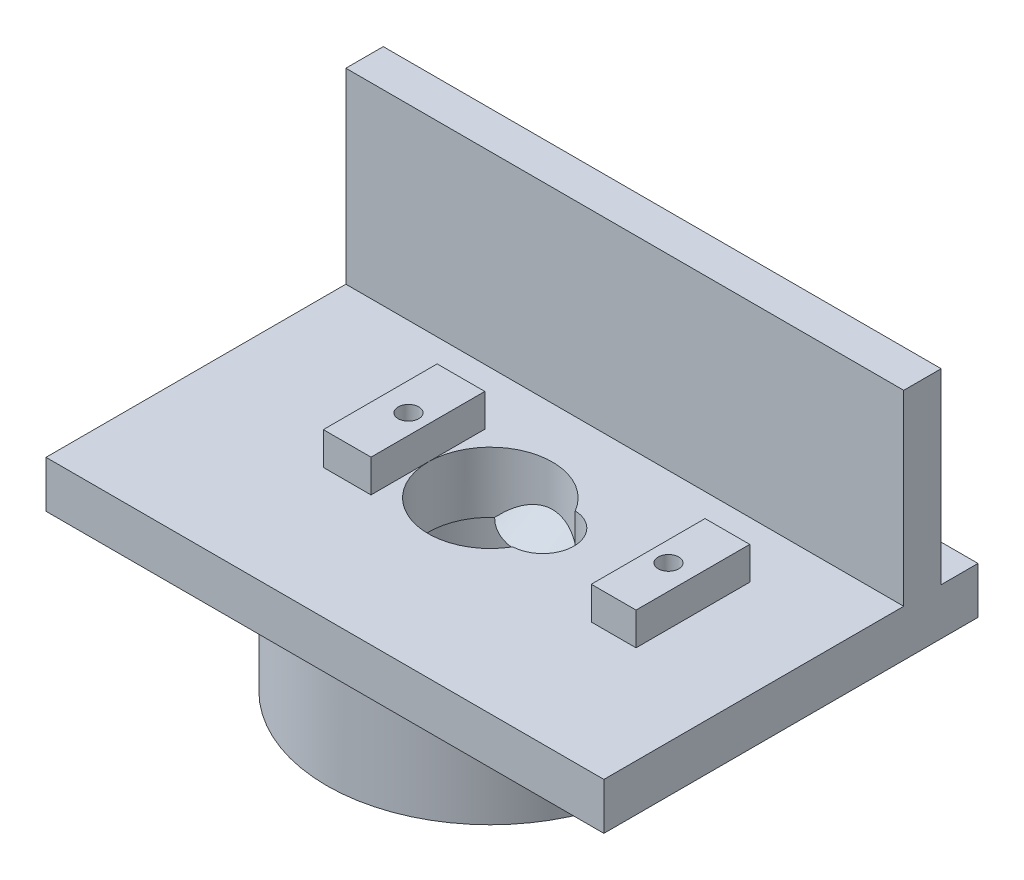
ISO-10303-21;
HEADER;
FILE_DESCRIPTION(('STEP AP214'),'2;1');
FILE_NAME('part.step','',(''),(''),'','','');
FILE_SCHEMA(('AUTOMOTIVE_DESIGN { 1 0 10303 214 1 1 1 1 }'));
ENDSEC;
DATA;
#1=APPLICATION_CONTEXT('core data for automotive mechanical design processes');
#2=APPLICATION_PROTOCOL_DEFINITION('international standard','automotive_design',2000,#1);
#3=PRODUCT_CONTEXT('',#1,'mechanical');
#4=PRODUCT('Part','Part','',(#3));
#5=PRODUCT_RELATED_PRODUCT_CATEGORY('part','',(#4));
#6=PRODUCT_DEFINITION_FORMATION('','',#4);
#7=PRODUCT_DEFINITION_CONTEXT('part definition',#1,'design');
#8=PRODUCT_DEFINITION('design','',#6,#7);
#9=PRODUCT_DEFINITION_SHAPE('','',#8);
#10=(LENGTH_UNIT() NAMED_UNIT(*) SI_UNIT(.MILLI.,.METRE.));
#11=(NAMED_UNIT(*) PLANE_ANGLE_UNIT() SI_UNIT($,.RADIAN.));
#12=(NAMED_UNIT(*) SI_UNIT($,.STERADIAN.) SOLID_ANGLE_UNIT());
#13=UNCERTAINTY_MEASURE_WITH_UNIT(LENGTH_MEASURE(1.E-05),#10,'distance_accuracy_value','');
#14=(GEOMETRIC_REPRESENTATION_CONTEXT(3) GLOBAL_UNCERTAINTY_ASSIGNED_CONTEXT((#13)) GLOBAL_UNIT_ASSIGNED_CONTEXT((#10,
#11,#12)) REPRESENTATION_CONTEXT('',''));
#15=CARTESIAN_POINT('',(0.,0.,0.));
#16=DIRECTION('',(0.,0.,1.));
#17=DIRECTION('',(1.,0.,0.));
#18=AXIS2_PLACEMENT_3D('',#15,#16,#17);
#19=CARTESIAN_POINT('',(0.,5.,0.));
#20=DIRECTION('',(0.,1.,0.));
#21=DIRECTION('',(0.,0.,1.));
#22=AXIS2_PLACEMENT_3D('',#19,#20,#21);
#23=PLANE('',#22);
#24=CARTESIAN_POINT('',(5.60000000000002,5.,0.));
#25=DIRECTION('',(0.,1.,0.));
#26=DIRECTION('',(0.,0.,1.));
#27=AXIS2_PLACEMENT_3D('',#24,#25,#26);
#28=CIRCLE('',#27,3.33940114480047);
#29=CARTESIAN_POINT('',(5.74102316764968,5.,3.33642210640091));
#30=VERTEX_POINT('',#29);
#31=CARTESIAN_POINT('',(5.74102316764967,5.,-3.33642210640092));
#32=VERTEX_POINT('',#31);
#33=EDGE_CURVE('E554',#30,#32,#28,.T.);
#34=ORIENTED_EDGE('',*,*,#33,.F.);
#35=CARTESIAN_POINT('',(0.,5.,0.));
#36=DIRECTION('',(0.,1.,0.));
#37=DIRECTION('',(0.,0.,1.));
#38=AXIS2_PLACEMENT_3D('',#35,#36,#37);
#39=CIRCLE('',#38,6.64010989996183);
#40=EDGE_CURVE('E556',#32,#30,#39,.T.);
#41=ORIENTED_EDGE('',*,*,#40,.F.);
#42=EDGE_LOOP('',(#34,#41));
#43=FACE_BOUND('',#42,.T.);
#44=DIRECTION('',(1.,0.,0.));
#45=VECTOR('',#44,1.);
#46=CARTESIAN_POINT('',(-11.7469523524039,5.,6.1086822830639));
#47=LINE('',#46,#45);
#48=CARTESIAN_POINT('',(-11.7469523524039,5.,6.1086822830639));
#49=VERTEX_POINT('',#48);
#50=CARTESIAN_POINT('',(-6.64931231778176,5.,6.1086822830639));
#51=VERTEX_POINT('',#50);
#52=EDGE_CURVE('E539',#49,#51,#47,.T.);
#53=ORIENTED_EDGE('',*,*,#52,.F.);
#54=DIRECTION('',(0.,0.,1.));
#55=VECTOR('',#54,1.);
#56=CARTESIAN_POINT('',(-11.7469523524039,5.,-6.05956487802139));
#57=LINE('',#56,#55);
#58=CARTESIAN_POINT('',(-11.7469523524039,5.,-6.05956487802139));
#59=VERTEX_POINT('',#58);
#60=EDGE_CURVE('E525',#59,#49,#57,.T.);
#61=ORIENTED_EDGE('',*,*,#60,.F.);
#62=DIRECTION('',(-1.,0.,0.));
#63=VECTOR('',#62,1.);
#64=CARTESIAN_POINT('',(-11.7469523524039,5.,-6.05956487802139));
#65=LINE('',#64,#63);
#66=CARTESIAN_POINT('',(-6.64931231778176,5.,-6.05956487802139));
#67=VERTEX_POINT('',#66);
#68=EDGE_CURVE('E530',#67,#59,#65,.T.);
#69=ORIENTED_EDGE('',*,*,#68,.F.);
#70=DIRECTION('',(0.,0.,-1.));
#71=VECTOR('',#70,1.);
#72=CARTESIAN_POINT('',(-6.64931231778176,5.,-6.05956487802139));
#73=LINE('',#72,#71);
#74=EDGE_CURVE('E541',#51,#67,#73,.T.);
#75=ORIENTED_EDGE('',*,*,#74,.F.);
#76=EDGE_LOOP('',(#53,#61,#69,#75));
#77=FACE_BOUND('',#76,.T.);
#78=DIRECTION('',(-1.,0.,0.));
#79=VECTOR('',#78,1.);
#80=CARTESIAN_POINT('',(21.6782188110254,5.,-6.05956487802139));
#81=LINE('',#80,#79);
#82=CARTESIAN_POINT('',(21.6782188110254,5.,-6.05956487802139));
#83=VERTEX_POINT('',#82);
#84=CARTESIAN_POINT('',(16.8970708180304,5.,-6.05956487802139));
#85=VERTEX_POINT('',#84);
#86=EDGE_CURVE('E510',#83,#85,#81,.T.);
#87=ORIENTED_EDGE('',*,*,#86,.F.);
#88=DIRECTION('',(0.,0.,-1.));
#89=VECTOR('',#88,1.);
#90=CARTESIAN_POINT('',(21.6782188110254,5.,-6.05956487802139));
#91=LINE('',#90,#89);
#92=CARTESIAN_POINT('',(21.6782188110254,5.,6.09999999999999));
#93=VERTEX_POINT('',#92);
#94=EDGE_CURVE('E491',#93,#83,#91,.T.);
#95=ORIENTED_EDGE('',*,*,#94,.F.);
#96=DIRECTION('',(1.,0.,0.));
#97=VECTOR('',#96,1.);
#98=CARTESIAN_POINT('',(21.6782188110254,5.,6.09999999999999));
#99=LINE('',#98,#97);
#100=CARTESIAN_POINT('',(16.8970708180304,5.,6.09999999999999));
#101=VERTEX_POINT('',#100);
#102=EDGE_CURVE('E501',#101,#93,#99,.T.);
#103=ORIENTED_EDGE('',*,*,#102,.F.);
#104=DIRECTION('',(0.,0.,1.));
#105=VECTOR('',#104,1.);
#106=CARTESIAN_POINT('',(16.8970708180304,5.,-6.05956487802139));
#107=LINE('',#106,#105);
#108=EDGE_CURVE('E512',#85,#101,#107,.T.);
#109=ORIENTED_EDGE('',*,*,#108,.F.);
#110=EDGE_LOOP('',(#87,#95,#103,#109));
#111=FACE_BOUND('',#110,.T.);
#112=DIRECTION('',(0.,0.,-1.));
#113=VECTOR('',#112,1.);
#114=CARTESIAN_POINT('',(32.1413684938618,5.,-20.));
#115=LINE('',#114,#113);
#116=CARTESIAN_POINT('',(32.1413684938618,5.,20.));
#117=VERTEX_POINT('',#116);
#118=CARTESIAN_POINT('',(32.1413684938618,5.,-12.0595648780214));
#119=VERTEX_POINT('',#118);
#120=EDGE_CURVE('E445',#117,#119,#115,.T.);
#121=ORIENTED_EDGE('',*,*,#120,.T.);
#122=DIRECTION('',(1.,0.,0.));
#123=VECTOR('',#122,1.);
#124=CARTESIAN_POINT('',(-27.5071638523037,5.,-12.0595648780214));
#125=LINE('',#124,#123);
#126=CARTESIAN_POINT('',(-27.5071638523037,5.,-12.0595648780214));
#127=VERTEX_POINT('',#126);
#128=EDGE_CURVE('E583',#127,#119,#125,.T.);
#129=ORIENTED_EDGE('',*,*,#128,.F.);
#130=DIRECTION('',(0.,0.,1.));
#131=VECTOR('',#130,1.);
#132=CARTESIAN_POINT('',(-27.5071638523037,5.,-20.));
#133=LINE('',#132,#131);
#134=CARTESIAN_POINT('',(-27.5071638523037,5.,20.));
#135=VERTEX_POINT('',#134);
#136=EDGE_CURVE('E228',#127,#135,#133,.T.);
#137=ORIENTED_EDGE('',*,*,#136,.T.);
#138=DIRECTION('',(1.,0.,0.));
#139=VECTOR('',#138,1.);
#140=CARTESIAN_POINT('',(-27.5071638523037,5.,20.));
#141=LINE('',#140,#139);
#142=EDGE_CURVE('E567',#135,#117,#141,.T.);
#143=ORIENTED_EDGE('',*,*,#142,.T.);
#144=EDGE_LOOP('',(#121,#129,#137,#143));
#145=FACE_BOUND('',#144,.T.);
#146=ADVANCED_FACE('F33',(#43,#77,#111,#145),#23,.T.);
#147=CARTESIAN_POINT('',(-27.5071638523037,5.,-20.));
#148=VERTEX_POINT('',#147);
#149=CARTESIAN_POINT('',(-27.5071638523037,5.,-16.0595648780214));
#150=VERTEX_POINT('',#149);
#151=EDGE_CURVE('E564',#148,#150,#133,.T.);
#152=ORIENTED_EDGE('',*,*,#151,.T.);
#153=DIRECTION('',(-1.,0.,0.));
#154=VECTOR('',#153,1.);
#155=CARTESIAN_POINT('',(-27.5071638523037,5.,-16.0595648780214));
#156=LINE('',#155,#154);
#157=CARTESIAN_POINT('',(-4.34082475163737,5.,-16.0595648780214));
#158=VERTEX_POINT('',#157);
#159=EDGE_CURVE('E582',#158,#150,#156,.T.);
#160=ORIENTED_EDGE('',*,*,#159,.F.);
#161=CARTESIAN_POINT('',(-6.57198953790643,4.99999999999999,-20.));
#162=CARTESIAN_POINT('',(-6.52194001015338,5.,-19.8184861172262));
#163=CARTESIAN_POINT('',(-6.46712433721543,5.,-19.6382650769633));
#164=CARTESIAN_POINT('',(-6.34759643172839,5.,-19.2805456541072));
#165=CARTESIAN_POINT('',(-6.28285538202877,5.,-19.1030569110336));
#166=CARTESIAN_POINT('',(-6.14333782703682,5.,-18.7518488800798));
#167=CARTESIAN_POINT('',(-6.06855150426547,5.,-18.5781334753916));
#168=CARTESIAN_POINT('',(-5.90777602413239,5.,-18.2342825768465));
#169=CARTESIAN_POINT('',(-5.82170349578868,5.,-18.0641859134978));
#170=CARTESIAN_POINT('',(-5.63838017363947,5.,-17.7302988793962));
#171=CARTESIAN_POINT('',(-5.5411402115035,5.,-17.5665026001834));
#172=CARTESIAN_POINT('',(-5.38692810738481,5.,-17.3262904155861));
#173=CARTESIAN_POINT('',(-5.33414883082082,5.,-17.2471559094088));
#174=CARTESIAN_POINT('',(-5.22579589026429,5.,-17.0908150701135));
#175=CARTESIAN_POINT('',(-5.17022218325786,5.00000000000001,-17.0136087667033));
#176=CARTESIAN_POINT('',(-5.05587429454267,5.00000000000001,-16.8608356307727));
#177=CARTESIAN_POINT('',(-4.99708201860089,5.,-16.7852823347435));
#178=CARTESIAN_POINT('',(-4.87662955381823,5.,-16.6365066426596));
#179=CARTESIAN_POINT('',(-4.81496960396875,5.,-16.5632840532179));
#180=CARTESIAN_POINT('',(-4.68880708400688,5.,-16.4193308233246));
#181=CARTESIAN_POINT('',(-4.62430460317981,5.,-16.3486001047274));
#182=CARTESIAN_POINT('',(-4.49252231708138,5.,-16.2097418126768));
#183=CARTESIAN_POINT('',(-4.42524163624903,5.,-16.1416150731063));
#184=CARTESIAN_POINT('',(-4.21984597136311,5.,-15.9418668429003));
#185=CARTESIAN_POINT('',(-4.07769977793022,5.,-15.8143315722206));
#186=CARTESIAN_POINT('',(-3.78302516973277,5.,-15.5719308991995));
#187=CARTESIAN_POINT('',(-3.63049862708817,4.99999999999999,-15.4570632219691));
#188=CARTESIAN_POINT('',(-3.31469450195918,4.99999999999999,-15.2406739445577));
#189=CARTESIAN_POINT('',(-3.15135074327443,5.,-15.1392486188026));
#190=CARTESIAN_POINT('',(-2.81598379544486,5.,-14.9518760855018));
#191=CARTESIAN_POINT('',(-2.64395943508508,5.,-14.8659309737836));
#192=CARTESIAN_POINT('',(-2.29260244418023,5.,-14.7101164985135));
#193=CARTESIAN_POINT('',(-2.11326364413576,5.,-14.6402610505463));
#194=CARTESIAN_POINT('',(-1.7488785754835,5.,-14.5175147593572));
#195=CARTESIAN_POINT('',(-1.56383300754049,5.,-14.4646218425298));
#196=CARTESIAN_POINT('',(-1.20566715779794,5.,-14.3803849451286));
#197=CARTESIAN_POINT('',(-1.03288960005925,5.,-14.3475791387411));
#198=CARTESIAN_POINT('',(-0.685130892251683,5.,-14.2972027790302));
#199=CARTESIAN_POINT('',(-0.510149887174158,5.,-14.2796312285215));
#200=CARTESIAN_POINT('',(-0.159422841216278,5.,-14.2599633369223));
#201=CARTESIAN_POINT('',(0.0163226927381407,5.,-14.2578579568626));
#202=CARTESIAN_POINT('',(0.367314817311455,5.,-14.2691281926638));
#203=CARTESIAN_POINT('',(0.542561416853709,5.00000000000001,-14.2825035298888));
#204=CARTESIAN_POINT('',(0.884384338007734,5.00000000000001,-14.3237292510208));
#205=CARTESIAN_POINT('',(1.05103179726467,5.,-14.3509933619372));
#206=CARTESIAN_POINT('',(1.38146857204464,5.,-14.419324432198));
#207=CARTESIAN_POINT('',(1.54525792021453,5.,-14.460391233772));
#208=CARTESIAN_POINT('',(1.86889547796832,5.,-14.5558765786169));
#209=CARTESIAN_POINT('',(2.0287435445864,5.,-14.6102956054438));
#210=CARTESIAN_POINT('',(2.3435263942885,5.,-14.731854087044));
#211=CARTESIAN_POINT('',(2.49846108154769,4.99999999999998,-14.7989937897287));
#212=CARTESIAN_POINT('',(2.80583973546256,4.99999999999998,-14.9472614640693));
#213=CARTESIAN_POINT('',(2.95814740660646,5.,-15.0286722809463));
#214=CARTESIAN_POINT('',(3.25551678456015,5.,-15.2037726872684));
#215=CARTESIAN_POINT('',(3.40057882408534,5.,-15.2974617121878));
#216=CARTESIAN_POINT('',(3.68263012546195,5.,-15.4961586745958));
#217=CARTESIAN_POINT('',(3.81962240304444,5.,-15.6011623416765));
#218=CARTESIAN_POINT('',(4.08510466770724,5.,-15.8214534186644));
#219=CARTESIAN_POINT('',(4.21359334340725,5.,-15.9367424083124));
#220=CARTESIAN_POINT('',(4.40303885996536,5.,-16.1196198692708));
#221=CARTESIAN_POINT('',(4.46717267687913,5.,-16.1839556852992));
#222=CARTESIAN_POINT('',(4.59295238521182,5.,-16.3149840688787));
#223=CARTESIAN_POINT('',(4.65459891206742,5.,-16.3816760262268));
#224=CARTESIAN_POINT('',(4.83571532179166,5.,-16.5851712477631));
#225=CARTESIAN_POINT('',(4.95136970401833,5.,-16.7254012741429));
#226=CARTESIAN_POINT('',(5.17250182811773,5.,-17.0140456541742));
#227=CARTESIAN_POINT('',(5.27795968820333,5.,-17.1624751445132));
#228=CARTESIAN_POINT('',(5.47868299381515,5.,-17.4660574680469));
#229=CARTESIAN_POINT('',(5.57394856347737,5.,-17.6212102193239));
#230=CARTESIAN_POINT('',(5.76358808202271,5.,-17.9539068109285));
#231=CARTESIAN_POINT('',(5.85682882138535,5.,-18.132096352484));
#232=CARTESIAN_POINT('',(6.03123908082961,5.,-18.4943176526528));
#233=CARTESIAN_POINT('',(6.11240506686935,5.,-18.6783511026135));
#234=CARTESIAN_POINT('',(6.26299553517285,5.,-19.0499915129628));
#235=CARTESIAN_POINT('',(6.33248060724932,5.,-19.2375740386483));
#236=CARTESIAN_POINT('',(6.46042033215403,5.,-19.6162901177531));
#237=CARTESIAN_POINT('',(6.51888435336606,5.,-19.8074205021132));
#238=CARTESIAN_POINT('',(6.57198953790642,4.99999999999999,-20.));
#239=B_SPLINE_CURVE_WITH_KNOTS('',3,(#161,#162,#163,#164,#165,#166,#167,#168,#169,#170,#171,
#172,#173,#174,#175,#176,#177,#178,#179,#180,#181,#182,#183,#184,#185,#186,#187,#188,#189,#190,
#191,#192,#193,#194,#195,#196,#197,#198,#199,#200,#201,#202,#203,#204,#205,#206,#207,#208,#209,
#210,#211,#212,#213,#214,#215,#216,#217,#218,#219,#220,#221,#222,#223,#224,#225,#226,#227,#228,
#229,#230,#231,#232,#233,#234,#235,#236,#237,#238),.UNSPECIFIED.,.F.,.F.,(4,2,2,2,2,2,2,2,2,2,2,
2,2,2,2,2,2,2,2,2,2,2,2,2,2,2,2,2,2,2,2,2,2,2,2,2,2,2,4),(0.,0.56482784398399,1.13132779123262,
1.69838547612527,2.26989667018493,2.84085814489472,3.12617075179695,3.41148775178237,
3.69861789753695,3.98572415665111,4.2728214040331,4.56000983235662,5.13221712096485,
5.70432148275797,6.28032419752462,6.85640483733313,7.43298186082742,8.00948837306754,
8.5364239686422,9.06332507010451,9.58991820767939,10.1165018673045,10.6225011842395,
11.1284947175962,11.6345065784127,12.1405283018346,12.6580324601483,13.1755128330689,
13.6927985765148,14.2101639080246,14.4826342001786,14.7550344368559,15.2998029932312,
15.845613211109,16.3914167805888,16.9942492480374,17.5972578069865,18.1970349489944,
18.796299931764),.UNSPECIFIED.);
#240=CARTESIAN_POINT('',(-6.57198953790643,4.99999999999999,-20.));
#241=VERTEX_POINT('',#240);
#242=EDGE_CURVE('E392',#241,#158,#239,.T.);
#243=ORIENTED_EDGE('',*,*,#242,.F.);
#244=DIRECTION('',(-1.,0.,0.));
#245=VECTOR('',#244,1.);
#246=CARTESIAN_POINT('',(-27.5071638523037,5.,-20.));
#247=LINE('',#246,#245);
#248=EDGE_CURVE('E571',#241,#148,#247,.T.);
#249=ORIENTED_EDGE('',*,*,#248,.T.);
#250=EDGE_LOOP('',(#152,#160,#243,#249));
#251=FACE_BOUND('',#250,.T.);
#252=ADVANCED_FACE('F386',(#251),#23,.T.);
#253=CARTESIAN_POINT('',(4.34082475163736,5.,-16.0595648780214));
#254=VERTEX_POINT('',#253);
#255=CARTESIAN_POINT('',(6.57198953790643,4.99999999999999,-20.));
#256=VERTEX_POINT('',#255);
#257=EDGE_CURVE('E400',#254,#256,#239,.T.);
#258=ORIENTED_EDGE('',*,*,#257,.F.);
#259=CARTESIAN_POINT('',(32.1413684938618,5.,-16.0595648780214));
#260=VERTEX_POINT('',#259);
#261=EDGE_CURVE('E54',#260,#254,#156,.T.);
#262=ORIENTED_EDGE('',*,*,#261,.F.);
#263=CARTESIAN_POINT('',(32.1413684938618,5.,-20.));
#264=VERTEX_POINT('',#263);
#265=EDGE_CURVE('E569',#260,#264,#115,.T.);
#266=ORIENTED_EDGE('',*,*,#265,.T.);
#267=EDGE_CURVE('E461',#264,#256,#247,.T.);
#268=ORIENTED_EDGE('',*,*,#267,.T.);
#269=EDGE_LOOP('',(#258,#262,#266,#268));
#270=FACE_BOUND('',#269,.T.);
#271=ADVANCED_FACE('F388',(#270),#23,.T.);
#272=CARTESIAN_POINT('',(-7.,-14.1551655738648,9.92491959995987));
#273=CARTESIAN_POINT('',(-7.,-13.788044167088,10.1368237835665));
#274=CARTESIAN_POINT('',(-6.82394234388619,-13.0538013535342,10.5606321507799));
#275=CARTESIAN_POINT('',(-6.18953615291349,-12.1842840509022,11.0625215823));
#276=CARTESIAN_POINT('',(-5.37450123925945,-11.5385260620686,11.4352560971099));
#277=CARTESIAN_POINT('',(-4.13548015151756,-10.8934775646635,11.807581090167));
#278=CARTESIAN_POINT('',(-2.3555582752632,-10.3922410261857,12.0968971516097));
#279=CARTESIAN_POINT('',(0.,-10.1912022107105,12.2129376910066));
#280=CARTESIAN_POINT('',(2.3555582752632,-10.3922410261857,12.0968971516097));
#281=CARTESIAN_POINT('',(4.13548015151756,-10.8934775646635,11.807581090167));
#282=CARTESIAN_POINT('',(5.37450123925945,-11.5385260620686,11.4352560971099));
#283=CARTESIAN_POINT('',(6.18953615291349,-12.1842840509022,11.0625215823));
#284=CARTESIAN_POINT('',(6.82394234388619,-13.0538013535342,10.5606321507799));
#285=CARTESIAN_POINT('',(7.08802882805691,-14.1551655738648,9.92491959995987));
#286=CARTESIAN_POINT('',(6.82394234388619,-15.2565297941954,9.28920704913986));
#287=CARTESIAN_POINT('',(6.18953615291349,-16.1260470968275,8.7873176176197));
#288=CARTESIAN_POINT('',(5.37450123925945,-16.7718050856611,8.41458310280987));
#289=CARTESIAN_POINT('',(4.13548015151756,-17.4168535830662,8.0422581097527));
#290=CARTESIAN_POINT('',(2.3555582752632,-17.9180901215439,7.75294204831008));
#291=CARTESIAN_POINT('',(0.,-18.1191289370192,7.63690150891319));
#292=CARTESIAN_POINT('',(-2.3555582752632,-17.9180901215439,7.75294204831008));
#293=CARTESIAN_POINT('',(-4.13548015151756,-17.4168535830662,8.0422581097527));
#294=CARTESIAN_POINT('',(-5.37450123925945,-16.7718050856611,8.41458310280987));
#295=CARTESIAN_POINT('',(-6.18953615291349,-16.1260470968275,8.7873176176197));
#296=CARTESIAN_POINT('',(-6.82394234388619,-15.2565297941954,9.28920704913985));
#297=CARTESIAN_POINT('',(-7.,-14.5222869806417,9.7130154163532));
#298=CARTESIAN_POINT('',(-7.,-14.1551655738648,9.92491959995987));
#299=B_SPLINE_CURVE_WITH_KNOTS('',3,(#272,#273,#274,#275,#276,#277,#278,#279,#280,#281,#282,
#283,#284,#285,#286,#287,#288,#289,#290,#291,#292,#293,#294,#295,#296,#297,#298),.UNSPECIFIED.,
.T.,.F.,(4,1,1,1,1,1,1,1,1,1,1,1,1,1,1,1,1,1,1,1,1,1,1,1,4),(0.,0.196349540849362,
0.392699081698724,0.589048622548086,0.785398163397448,1.17809724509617,1.5707963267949,
1.96349540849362,2.35619449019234,2.55254403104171,2.74889357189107,2.94524311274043,
3.14159265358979,3.33794219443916,3.53429173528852,3.73064127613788,3.92699081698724,
4.31968989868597,4.71238898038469,5.10508806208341,5.49778714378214,5.6941366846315,
5.89048622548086,6.08683576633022,6.28318530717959),.UNSPECIFIED.);
#300=DIRECTION('',(0.,0.499905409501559,-0.866080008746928));
#301=VECTOR('',#300,1.);
#302=SURFACE_OF_LINEAR_EXTRUSION('',#299,#301);
#303=CARTESIAN_POINT('',(-7.,5.,-23.2611705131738));
#304=CARTESIAN_POINT('',(-7.,5.36712140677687,-23.0492663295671));
#305=CARTESIAN_POINT('',(-6.82394234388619,6.1013642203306,-22.6254579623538));
#306=CARTESIAN_POINT('',(-6.18953615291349,6.97088152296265,-22.1235685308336));
#307=CARTESIAN_POINT('',(-5.37450123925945,7.61663951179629,-21.7508340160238));
#308=CARTESIAN_POINT('',(-4.13548015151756,8.26168800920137,-21.3785090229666));
#309=CARTESIAN_POINT('',(-2.3555582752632,8.76292454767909,-21.089192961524));
#310=CARTESIAN_POINT('',(0.,8.96396336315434,-20.9731524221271));
#311=CARTESIAN_POINT('',(2.3555582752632,8.76292454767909,-21.089192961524));
#312=CARTESIAN_POINT('',(4.13548015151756,8.26168800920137,-21.3785090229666));
#313=CARTESIAN_POINT('',(5.37450123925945,7.61663951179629,-21.7508340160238));
#314=CARTESIAN_POINT('',(6.18953615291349,6.97088152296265,-22.1235685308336));
#315=CARTESIAN_POINT('',(6.82394234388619,6.1013642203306,-22.6254579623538));
#316=CARTESIAN_POINT('',(7.08802882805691,5.,-23.2611705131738));
#317=CARTESIAN_POINT('',(6.82394234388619,3.8986357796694,-23.8968830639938));
#318=CARTESIAN_POINT('',(6.18953615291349,3.02911847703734,-24.398772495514));
#319=CARTESIAN_POINT('',(5.37450123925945,2.38336048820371,-24.7715070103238));
#320=CARTESIAN_POINT('',(4.13548015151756,1.73831199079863,-25.143832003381));
#321=CARTESIAN_POINT('',(2.3555582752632,1.2370754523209,-25.4331480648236));
#322=CARTESIAN_POINT('',(0.,1.03603663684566,-25.5491886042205));
#323=CARTESIAN_POINT('',(-2.3555582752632,1.2370754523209,-25.4331480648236));
#324=CARTESIAN_POINT('',(-4.13548015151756,1.73831199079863,-25.143832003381));
#325=CARTESIAN_POINT('',(-5.37450123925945,2.38336048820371,-24.7715070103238));
#326=CARTESIAN_POINT('',(-6.18953615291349,3.02911847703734,-24.398772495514));
#327=CARTESIAN_POINT('',(-6.82394234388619,3.89863577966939,-23.8968830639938));
#328=CARTESIAN_POINT('',(-7.,4.63287859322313,-23.4730746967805));
#329=CARTESIAN_POINT('',(-7.,5.,-23.2611705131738));
#330=B_SPLINE_CURVE_WITH_KNOTS('',3,(#303,#304,#305,#306,#307,#308,#309,#310,#311,#312,#313,
#314,#315,#316,#317,#318,#319,#320,#321,#322,#323,#324,#325,#326,#327,#328,#329),.UNSPECIFIED.,
.T.,.F.,(4,1,1,1,1,1,1,1,1,1,1,1,1,1,1,1,1,1,1,1,1,1,1,1,4),(0.,0.196349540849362,
0.392699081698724,0.589048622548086,0.785398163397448,1.17809724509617,1.5707963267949,
1.96349540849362,2.35619449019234,2.55254403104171,2.74889357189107,2.94524311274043,
3.14159265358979,3.33794219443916,3.53429173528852,3.73064127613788,3.92699081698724,
4.31968989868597,4.71238898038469,5.10508806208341,5.49778714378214,5.6941366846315,
5.89048622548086,6.08683576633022,6.28318530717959),.UNSPECIFIED.);
#331=CARTESIAN_POINT('',(-7.,5.,-23.2611705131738));
#332=VERTEX_POINT('',#331);
#333=EDGE_CURVE('E236',#332,#332,#330,.T.);
#334=ORIENTED_EDGE('',*,*,#333,.F.);
#335=EDGE_LOOP('',(#334));
#336=FACE_BOUND('',#335,.T.);
#337=ORIENTED_EDGE('',*,*,#242,.T.);
#338=CARTESIAN_POINT('',(-4.34082475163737,5.,-16.0595648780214));
#339=CARTESIAN_POINT('',(-4.21561948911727,5.069869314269,-16.0595648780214));
#340=CARTESIAN_POINT('',(-4.08823912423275,5.13577571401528,-16.0595648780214));
#341=CARTESIAN_POINT('',(-3.8300221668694,5.25976463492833,-16.0595648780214));
#342=CARTESIAN_POINT('',(-3.69919269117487,5.31786195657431,-16.0595648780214));
#343=CARTESIAN_POINT('',(-3.43455840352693,5.42657149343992,-16.0595648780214));
#344=CARTESIAN_POINT('',(-3.30075528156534,5.47718784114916,-16.0595648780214));
#345=CARTESIAN_POINT('',(-3.03065437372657,5.57129489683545,-16.0595648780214));
#346=CARTESIAN_POINT('',(-2.8943562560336,5.61478464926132,-16.0595648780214));
#347=CARTESIAN_POINT('',(-2.61971326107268,5.69500043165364,-16.0595648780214));
#348=CARTESIAN_POINT('',(-2.48136733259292,5.73172284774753,-16.0595648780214));
#349=CARTESIAN_POINT('',(-2.20309211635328,5.79876961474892,-16.0595648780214));
#350=CARTESIAN_POINT('',(-2.06316229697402,5.82909174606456,-16.0595648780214));
#351=CARTESIAN_POINT('',(-1.73550103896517,5.89250952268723,-16.0595648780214));
#352=CARTESIAN_POINT('',(-1.5472989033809,5.92319306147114,-16.0595648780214));
#353=CARTESIAN_POINT('',(-1.16946793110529,5.9737697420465,-16.0595648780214));
#354=CARTESIAN_POINT('',(-0.979839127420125,5.99366313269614,-16.0595648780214));
#355=CARTESIAN_POINT('',(-0.599769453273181,6.02284717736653,-16.0595648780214));
#356=CARTESIAN_POINT('',(-0.409328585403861,6.03213786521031,-16.0595648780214));
#357=CARTESIAN_POINT('',(-0.0280843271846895,6.04019746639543,-16.0595648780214));
#358=CARTESIAN_POINT('',(0.162719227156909,6.03895858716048,-16.0595648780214));
#359=CARTESIAN_POINT('',(0.543965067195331,6.02593095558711,-16.0595648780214));
#360=CARTESIAN_POINT('',(0.734407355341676,6.01414227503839,-16.0595648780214));
#361=CARTESIAN_POINT('',(1.11437812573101,5.97990990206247,-16.0595648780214));
#362=CARTESIAN_POINT('',(1.30390641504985,5.95746405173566,-16.0595648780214));
#363=CARTESIAN_POINT('',(1.65827508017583,5.9051102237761,-16.0595648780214));
#364=CARTESIAN_POINT('',(1.82330047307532,5.87645028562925,-16.0595648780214));
#365=CARTESIAN_POINT('',(2.15159076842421,5.81058102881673,-16.0595648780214));
#366=CARTESIAN_POINT('',(2.31485620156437,5.77337436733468,-16.0595648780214));
#367=CARTESIAN_POINT('',(2.6389999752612,5.6900700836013,-16.0595648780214));
#368=CARTESIAN_POINT('',(2.7998798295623,5.6439783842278,-16.0595648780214));
#369=CARTESIAN_POINT('',(3.11845822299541,5.54231431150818,-16.0595648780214));
#370=CARTESIAN_POINT('',(3.27615971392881,5.48675123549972,-16.0595648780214));
#371=CARTESIAN_POINT('',(3.58777943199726,5.36554839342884,-16.0595648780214));
#372=CARTESIAN_POINT('',(3.74169525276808,5.29990240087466,-16.0595648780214));
#373=CARTESIAN_POINT('',(4.04501200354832,5.15800017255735,-16.0595648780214));
#374=CARTESIAN_POINT('',(4.19440076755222,5.08171798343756,-16.0595648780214));
#375=CARTESIAN_POINT('',(4.34082475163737,5.,-16.0595648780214));
#376=B_SPLINE_CURVE_WITH_KNOTS('',3,(#338,#339,#340,#341,#342,#343,#344,#345,#346,#347,#348,
#349,#350,#351,#352,#353,#354,#355,#356,#357,#358,#359,#360,#361,#362,#363,#364,#365,#366,#367,
#368,#369,#370,#371,#372,#373,#374,#375),.UNSPECIFIED.,.F.,.F.,(4,2,2,2,2,2,2,2,2,2,2,2,2,2,2,2,
2,2,4),(0.,0.430025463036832,0.859224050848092,1.28818465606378,1.71720273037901,
2.14644924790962,2.57584438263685,3.14756812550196,3.71927868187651,4.29098741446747,
4.86311928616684,5.43524726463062,6.00749113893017,6.50976318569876,7.01187928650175,
7.5136618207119,8.01495459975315,8.51655819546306,9.01940789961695),.UNSPECIFIED.);
#377=EDGE_CURVE('E11',#158,#254,#376,.T.);
#378=ORIENTED_EDGE('',*,*,#377,.T.);
#379=ORIENTED_EDGE('',*,*,#257,.T.);
#380=CARTESIAN_POINT('',(5.70941927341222,0.,-20.));
#381=CARTESIAN_POINT('',(5.75981311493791,0.0523473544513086,-20.));
#382=CARTESIAN_POINT('',(5.80906938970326,0.105793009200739,-20.));
#383=CARTESIAN_POINT('',(5.90515804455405,0.214800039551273,-20.));
#384=CARTESIAN_POINT('',(5.9519909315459,0.270360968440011,-20.));
#385=CARTESIAN_POINT('',(6.043165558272,0.383614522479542,-20.));
#386=CARTESIAN_POINT('',(6.08750392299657,0.441309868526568,-20.));
#387=CARTESIAN_POINT('',(6.17354732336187,0.558669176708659,-20.));
#388=CARTESIAN_POINT('',(6.21525103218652,0.618334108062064,-20.));
#389=CARTESIAN_POINT('',(6.33611592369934,0.800081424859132,-20.));
#390=CARTESIAN_POINT('',(6.41109153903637,0.924991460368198,-20.));
#391=CARTESIAN_POINT('',(6.54849686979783,1.18151631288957,-20.));
#392=CARTESIAN_POINT('',(6.61093019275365,1.31312918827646,-20.));
#393=CARTESIAN_POINT('',(6.69177038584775,1.50839780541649,-20.));
#394=CARTESIAN_POINT('',(6.71558233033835,1.56985641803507,-20.));
#395=CARTESIAN_POINT('',(6.76033864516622,1.69380875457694,-20.));
#396=CARTESIAN_POINT('',(6.78128307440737,1.75630245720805,-20.));
#397=CARTESIAN_POINT('',(6.83986086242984,1.94514639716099,-20.));
#398=CARTESIAN_POINT('',(6.87323078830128,2.07284022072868,-20.));
#399=CARTESIAN_POINT('',(6.92865301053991,2.33049320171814,-20.));
#400=CARTESIAN_POINT('',(6.95071926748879,2.4604493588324,-20.));
#401=CARTESIAN_POINT('',(6.97507590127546,2.65641292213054,-20.));
#402=CARTESIAN_POINT('',(6.98173744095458,2.72189953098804,-20.));
#403=CARTESIAN_POINT('',(6.9920679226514,2.85311127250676,-20.));
#404=CARTESIAN_POINT('',(6.99573698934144,2.91883639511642,-20.));
#405=CARTESIAN_POINT('',(6.99983350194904,3.04631355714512,-20.));
#406=CARTESIAN_POINT('',(7.00044763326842,3.1080595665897,-20.));
#407=CARTESIAN_POINT('',(6.99888842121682,3.23151227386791,-20.));
#408=CARTESIAN_POINT('',(6.99671506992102,3.29321897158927,-20.));
#409=CARTESIAN_POINT('',(6.98618559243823,3.47814281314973,-20.));
#410=CARTESIAN_POINT('',(6.97381971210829,3.60115255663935,-20.));
#411=CARTESIAN_POINT('',(6.93895320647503,3.84561043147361,-20.));
#412=CARTESIAN_POINT('',(6.9164592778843,3.96705954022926,-20.));
#413=CARTESIAN_POINT('',(6.86160362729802,4.20767211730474,-20.));
#414=CARTESIAN_POINT('',(6.82924714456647,4.32683676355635,-20.));
#415=CARTESIAN_POINT('',(6.77680073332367,4.49194416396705,-20.));
#416=CARTESIAN_POINT('',(6.76087732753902,4.53924022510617,-20.));
#417=CARTESIAN_POINT('',(6.72738593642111,4.63323850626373,-20.));
#418=CARTESIAN_POINT('',(6.70981830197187,4.67994085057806,-20.));
#419=CARTESIAN_POINT('',(6.6731168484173,4.77259887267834,-20.));
#420=CARTESIAN_POINT('',(6.6539867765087,4.81855603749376,-20.));
#421=CARTESIAN_POINT('',(6.6141563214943,4.90979750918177,-20.));
#422=CARTESIAN_POINT('',(6.59345557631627,4.95508165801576,-20.));
#423=CARTESIAN_POINT('',(6.57198953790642,4.99999999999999,-20.));
#424=B_SPLINE_CURVE_WITH_KNOTS('',3,(#380,#381,#382,#383,#384,#385,#386,#387,#388,#389,#390,
#391,#392,#393,#394,#395,#396,#397,#398,#399,#400,#401,#402,#403,#404,#405,#406,#407,#408,#409,
#410,#411,#412,#413,#414,#415,#416,#417,#418,#419,#420,#421,#422,#423),.UNSPECIFIED.,.F.,.F.,(4,
2,2,2,2,2,2,2,2,2,2,2,2,2,2,2,2,2,2,2,2,4),(0.,0.217972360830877,0.435898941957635,
0.654113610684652,0.872437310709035,1.30879611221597,1.74502922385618,1.94270064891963,
2.14036801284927,2.53576495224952,2.93067237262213,3.12808939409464,3.3254981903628,
3.51068118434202,3.69586470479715,4.0662650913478,4.43642092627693,4.80638046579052,
4.95607147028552,5.10573060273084,5.25504079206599,5.40438550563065),.UNSPECIFIED.);
#425=CARTESIAN_POINT('',(5.70941927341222,0.,-20.));
#426=VERTEX_POINT('',#425);
#427=EDGE_CURVE('E401',#426,#256,#424,.T.);
#428=ORIENTED_EDGE('',*,*,#427,.F.);
#429=CARTESIAN_POINT('',(-5.70941927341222,0.,-20.));
#430=CARTESIAN_POINT('',(-5.79561331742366,0.,-19.8449092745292));
#431=CARTESIAN_POINT('',(-5.87686559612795,0.,-19.687136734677));
#432=CARTESIAN_POINT('',(-6.02986980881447,0.,-19.3673630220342));
#433=CARTESIAN_POINT('',(-6.10163726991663,0.,-19.2053692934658));
#434=CARTESIAN_POINT('',(-6.23630351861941,0.,-18.8778506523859));
#435=CARTESIAN_POINT('',(-6.29920675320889,0.,-18.7123275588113));
#436=CARTESIAN_POINT('',(-6.41619793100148,0.,-18.3787321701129));
#437=CARTESIAN_POINT('',(-6.47031067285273,0.,-18.2106685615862));
#438=CARTESIAN_POINT('',(-6.57015443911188,0.,-17.8720025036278));
#439=CARTESIAN_POINT('',(-6.61588202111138,0.,-17.7013990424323));
#440=CARTESIAN_POINT('',(-6.69915440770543,0.,-17.3581477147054));
#441=CARTESIAN_POINT('',(-6.7366964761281,0.,-17.185499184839));
#442=CARTESIAN_POINT('',(-6.79288885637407,0.,-16.8953285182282));
#443=CARTESIAN_POINT('',(-6.81370451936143,0.,-16.7782198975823));
#444=CARTESIAN_POINT('',(-6.85194661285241,0.,-16.5434506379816));
#445=CARTESIAN_POINT('',(-6.86937292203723,0.,-16.4257899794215));
#446=CARTESIAN_POINT('',(-6.91674872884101,0.,-16.0721176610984));
#447=CARTESIAN_POINT('',(-6.94179345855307,0.,-15.8354242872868));
#448=CARTESIAN_POINT('',(-6.96970396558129,0.,-15.4796658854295));
#449=CARTESIAN_POINT('',(-6.97739823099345,0.,-15.3609519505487));
#450=CARTESIAN_POINT('',(-6.98951550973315,0.,-15.1233526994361));
#451=CARTESIAN_POINT('',(-6.993938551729,0.,-15.0044673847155));
#452=CARTESIAN_POINT('',(-6.99942498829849,0.,-14.7662587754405));
#453=CARTESIAN_POINT('',(-7.00047815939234,0.,-14.6469352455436));
#454=CARTESIAN_POINT('',(-6.99911023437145,0.,-14.4083077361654));
#455=CARTESIAN_POINT('',(-6.99668912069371,0.,-14.2890037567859));
#456=CARTESIAN_POINT('',(-6.98851453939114,0.,-14.0505283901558));
#457=CARTESIAN_POINT('',(-6.98276156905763,0.,-13.9313569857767));
#458=CARTESIAN_POINT('',(-6.96798403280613,0.,-13.6932201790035));
#459=CARTESIAN_POINT('',(-6.95895946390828,0.,-13.5742547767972));
#460=CARTESIAN_POINT('',(-6.92704531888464,0.,-13.2178333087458));
#461=CARTESIAN_POINT('',(-6.8993133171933,0.,-12.9807952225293));
#462=CARTESIAN_POINT('',(-6.82429247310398,0.,-12.4658531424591));
#463=CARTESIAN_POINT('',(-6.77437091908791,0.,-12.1883248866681));
#464=CARTESIAN_POINT('',(-6.65388092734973,0.,-11.6377820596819));
#465=CARTESIAN_POINT('',(-6.58331471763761,0.,-11.364767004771));
#466=CARTESIAN_POINT('',(-6.42092433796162,0.,-10.8259426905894));
#467=CARTESIAN_POINT('',(-6.32916397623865,0.,-10.5601144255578));
#468=CARTESIAN_POINT('',(-6.17501370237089,0.,-10.1679416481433));
#469=CARTESIAN_POINT('',(-6.12087645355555,0.,-10.0383078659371));
#470=CARTESIAN_POINT('',(-6.00688829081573,0.,-9.78157089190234));
#471=CARTESIAN_POINT('',(-5.94703786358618,0.,-9.65446748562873));
#472=CARTESIAN_POINT('',(-5.83669282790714,0.,-9.43389730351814));
#473=CARTESIAN_POINT('',(-5.78747738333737,0.,-9.33978860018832));
#474=CARTESIAN_POINT('',(-5.68556917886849,0.,-9.15347369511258));
#475=CARTESIAN_POINT('',(-5.63287655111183,0.,-9.06126742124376));
#476=CARTESIAN_POINT('',(-5.52399078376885,0.,-8.87896718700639));
#477=CARTESIAN_POINT('',(-5.46779827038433,0.,-8.78887285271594));
#478=CARTESIAN_POINT('',(-5.35194227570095,0.,-8.61093692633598));
#479=CARTESIAN_POINT('',(-5.29227863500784,0.,-8.52309543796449));
#480=CARTESIAN_POINT('',(-5.1694415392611,0.,-8.34987895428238));
#481=CARTESIAN_POINT('',(-5.10626756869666,0.,-8.26450432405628));
#482=CARTESIAN_POINT('',(-4.97638474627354,0.,-8.09650266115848));
#483=CARTESIAN_POINT('',(-4.90967633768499,0.,-8.01387528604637));
#484=CARTESIAN_POINT('',(-4.77273489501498,0.,-7.85158860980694));
#485=CARTESIAN_POINT('',(-4.70250184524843,0.,-7.77192932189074));
#486=CARTESIAN_POINT('',(-4.55856896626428,0.,-7.61575873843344));
#487=CARTESIAN_POINT('',(-4.48486771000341,-2.15673922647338E-13,-7.53924876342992));
#488=CARTESIAN_POINT('',(-4.2574329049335,-3.91917658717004E-13,-7.3134149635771));
#489=CARTESIAN_POINT('',(-4.0985511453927,-1.04931342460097E-13,-7.16919211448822));
#490=CARTESIAN_POINT('',(-3.76768311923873,1.04904691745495E-13,-6.89672701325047));
#491=CARTESIAN_POINT('',(-3.59570019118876,0.,-6.76848071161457));
#492=CARTESIAN_POINT('',(-3.23972415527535,0.,-6.53001443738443));
#493=CARTESIAN_POINT('',(-3.0557358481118,0.,-6.41978732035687));
#494=CARTESIAN_POINT('',(-2.67738483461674,0.,-6.21885201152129));
#495=CARTESIAN_POINT('',(-2.48302232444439,0.,-6.12814345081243));
#496=CARTESIAN_POINT('',(-2.11498304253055,0.,-5.97879927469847));
#497=CARTESIAN_POINT('',(-1.94241420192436,0.,-5.91741689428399));
#498=CARTESIAN_POINT('',(-1.59250513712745,0.,-5.8102760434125));
#499=CARTESIAN_POINT('',(-1.41516576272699,0.,-5.76451480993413));
#500=CARTESIAN_POINT('',(-1.05714954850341,0.,-5.68922841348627));
#501=CARTESIAN_POINT('',(-0.876474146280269,0.,-5.65969641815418));
#502=CARTESIAN_POINT('',(-0.513176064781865,0.,-5.61724331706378));
#503=CARTESIAN_POINT('',(-0.330553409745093,0.,-5.60432200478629));
#504=CARTESIAN_POINT('',(0.0234231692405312,0.,-5.59556898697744));
#505=CARTESIAN_POINT('',(0.19475225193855,0.,-5.59869900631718));
#506=CARTESIAN_POINT('',(0.536510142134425,0.,-5.61963763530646));
#507=CARTESIAN_POINT('',(0.706938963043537,0.,-5.63744602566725));
#508=CARTESIAN_POINT('',(1.04564605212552,0.,-5.6875166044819));
#509=CARTESIAN_POINT('',(1.21392443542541,0.,-5.71977801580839));
#510=CARTESIAN_POINT('',(1.54716670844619,0.,-5.7983758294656));
#511=CARTESIAN_POINT('',(1.71213041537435,0.,-5.84471300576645));
#512=CARTESIAN_POINT('',(2.03608398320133,0.,-5.9504141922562));
#513=CARTESIAN_POINT('',(2.1951157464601,0.,-6.00965007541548));
#514=CARTESIAN_POINT('',(2.50785753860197,0.,-6.14078736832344));
#515=CARTESIAN_POINT('',(2.66156787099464,0.,-6.21268805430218));
#516=CARTESIAN_POINT('',(2.96259052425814,0.,-6.36876994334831));
#517=CARTESIAN_POINT('',(3.10990390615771,0.,-6.45294909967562));
#518=CARTESIAN_POINT('',(3.39727124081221,0.,-6.63288774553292));
#519=CARTESIAN_POINT('',(3.53732508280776,0.,-6.72864741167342));
#520=CARTESIAN_POINT('',(3.81480308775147,0.,-6.93475764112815));
#521=CARTESIAN_POINT('',(3.95191282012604,0.,-7.04553099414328));
#522=CARTESIAN_POINT('',(4.21714200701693,0.,-7.2773469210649));
#523=CARTESIAN_POINT('',(4.34526088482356,0.,-7.3983901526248));
#524=CARTESIAN_POINT('',(4.59233101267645,0.,-7.64958391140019));
#525=CARTESIAN_POINT('',(4.71127830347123,0.,-7.77973832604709));
#526=CARTESIAN_POINT('',(4.93945833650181,0.,-8.04831497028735));
#527=CARTESIAN_POINT('',(5.04869049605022,0.,-8.18673769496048));
#528=CARTESIAN_POINT('',(5.22570953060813,0.,-8.42755875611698));
#529=CARTESIAN_POINT('',(5.29600732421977,0.,-8.52812828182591));
#530=CARTESIAN_POINT('',(5.43198724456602,0.,-8.73235368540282));
#531=CARTESIAN_POINT('',(5.49766906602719,0.,-8.83600976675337));
#532=CARTESIAN_POINT('',(5.62436780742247,0.,-9.04617852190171));
#533=CARTESIAN_POINT('',(5.68538316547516,0.,-9.15269213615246));
#534=CARTESIAN_POINT('',(5.80276664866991,0.,-9.36824357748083));
#535=CARTESIAN_POINT('',(5.85913487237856,0.,-9.4772813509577));
#536=CARTESIAN_POINT('',(5.96741628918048,0.,-9.69775110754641));
#537=CARTESIAN_POINT('',(6.01932254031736,0.,-9.80918649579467));
#538=CARTESIAN_POINT('',(6.11876329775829,0.,-10.0339837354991));
#539=CARTESIAN_POINT('',(6.16629775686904,0.,-10.147345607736));
#540=CARTESIAN_POINT('',(6.30254832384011,0.,-10.4899223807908));
#541=CARTESIAN_POINT('',(6.3849356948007,-1.28952551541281E-13,-10.7216779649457));
#542=CARTESIAN_POINT('',(6.56013676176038,-1.76753783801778E-13,-11.2753514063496));
#543=CARTESIAN_POINT('',(6.64590575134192,0.,-11.5995020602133));
#544=CARTESIAN_POINT('',(6.78837298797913,0.,-12.2542141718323));
#545=CARTESIAN_POINT('',(6.84505698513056,0.,-12.5847786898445));
#546=CARTESIAN_POINT('',(6.91073081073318,0.,-13.0834571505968));
#547=CARTESIAN_POINT('',(6.92940842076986,0.,-13.2503752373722));
#548=CARTESIAN_POINT('',(6.96034307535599,0.,-13.584814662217));
#549=CARTESIAN_POINT('',(6.97260021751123,0.,-13.7523359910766));
#550=CARTESIAN_POINT('',(6.99061783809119,0.,-14.0876966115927));
#551=CARTESIAN_POINT('',(6.99637966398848,0.,-14.2555358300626));
#552=CARTESIAN_POINT('',(6.9999409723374,0.,-14.5073579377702));
#553=CARTESIAN_POINT('',(7.00028114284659,0.,-14.5913102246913));
#554=CARTESIAN_POINT('',(6.99924226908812,0.,-14.7592042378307));
#555=CARTESIAN_POINT('',(6.99786321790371,0.,-14.8431459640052));
#556=CARTESIAN_POINT('',(6.99116835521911,0.,-15.0972249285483));
#557=CARTESIAN_POINT('',(6.98326338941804,0.,-15.2673001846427));
#558=CARTESIAN_POINT('',(6.96082238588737,0.,-15.6070163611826));
#559=CARTESIAN_POINT('',(6.9462859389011,0.,-15.7766572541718));
#560=CARTESIAN_POINT('',(6.9106000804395,0.,-16.1153050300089));
#561=CARTESIAN_POINT('',(6.88944835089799,0.,-16.2843116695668));
#562=CARTESIAN_POINT('',(6.84036885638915,0.,-16.6213315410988));
#563=CARTESIAN_POINT('',(6.81244149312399,0.,-16.7893448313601));
#564=CARTESIAN_POINT('',(6.74944195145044,0.,-17.1232209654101));
#565=CARTESIAN_POINT('',(6.71440409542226,0.,-17.2890902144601));
#566=CARTESIAN_POINT('',(6.63680528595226,0.,-17.6190472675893));
#567=CARTESIAN_POINT('',(6.59424386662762,0.,-17.7831349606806));
#568=CARTESIAN_POINT('',(6.45505369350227,0.,-18.2718449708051));
#569=CARTESIAN_POINT('',(6.34684168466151,0.,-18.593332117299));
#570=CARTESIAN_POINT('',(6.18576230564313,0.,-19.0018710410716));
#571=CARTESIAN_POINT('',(6.14746401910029,0.,-19.0948557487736));
#572=CARTESIAN_POINT('',(6.06798226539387,0.,-19.2795735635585));
#573=CARTESIAN_POINT('',(6.02679937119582,0.,-19.371306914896));
#574=CARTESIAN_POINT('',(5.94139358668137,0.,-19.5534532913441));
#575=CARTESIAN_POINT('',(5.8971678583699,0.,-19.6438649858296));
#576=CARTESIAN_POINT('',(5.80562683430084,0.,-19.8231407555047));
#577=CARTESIAN_POINT('',(5.7583106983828,0.,-19.9120044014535));
#578=CARTESIAN_POINT('',(5.7094192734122,0.,-20.));
#579=B_SPLINE_CURVE_WITH_KNOTS('',3,(#429,#430,#431,#432,#433,#434,#435,#436,#437,#438,#439,
#440,#441,#442,#443,#444,#445,#446,#447,#448,#449,#450,#451,#452,#453,#454,#455,#456,#457,#458,
#459,#460,#461,#462,#463,#464,#465,#466,#467,#468,#469,#470,#471,#472,#473,#474,#475,#476,#477,
#478,#479,#480,#481,#482,#483,#484,#485,#486,#487,#488,#489,#490,#491,#492,#493,#494,#495,#496,
#497,#498,#499,#500,#501,#502,#503,#504,#505,#506,#507,#508,#509,#510,#511,#512,#513,#514,#515,
#516,#517,#518,#519,#520,#521,#522,#523,#524,#525,#526,#527,#528,#529,#530,#531,#532,#533,#534,
#535,#536,#537,#538,#539,#540,#541,#542,#543,#544,#545,#546,#547,#548,#549,#550,#551,#552,#553,
#554,#555,#556,#557,#558,#559,#560,#561,#562,#563,#564,#565,#566,#567,#568,#569,#570,#571,#572,
#573,#574,#575,#576,#577,#578),.UNSPECIFIED.,.F.,.F.,(4,2,2,2,2,2,2,2,2,2,2,2,2,2,2,2,2,2,2,2,2,
2,2,2,2,2,2,2,2,2,2,2,2,2,2,2,2,2,2,2,2,2,2,2,2,2,2,2,2,2,2,2,2,2,2,2,2,2,2,2,2,2,2,2,2,2,2,2,2,
2,2,2,2,2,4),(0.,0.532127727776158,1.06337325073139,1.59435130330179,2.1238043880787,
2.65347434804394,3.18332109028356,3.54010335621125,3.89689839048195,4.61051477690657,
4.96737138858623,5.32422487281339,5.68215995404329,6.0400968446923,6.39798032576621,
6.75586413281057,7.47146159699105,8.31669138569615,9.16182998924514,10.0044565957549,
10.4257996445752,10.8471068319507,11.1656420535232,11.484165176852,11.8026314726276,
12.1211124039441,12.4396402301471,12.7581282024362,13.0766175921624,13.3952391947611,
14.0379729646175,14.6805434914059,15.3228586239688,15.9651616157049,16.5139557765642,
17.0626528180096,17.6111186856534,18.159577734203,18.6730254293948,19.1864654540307,
19.6998778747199,20.2133185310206,20.7218744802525,21.2304013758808,21.7388436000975,
22.2472935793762,22.7755299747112,23.3038002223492,23.832297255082,24.3608259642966,
24.7288165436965,25.0968314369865,25.4649689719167,25.8330986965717,26.2017911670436,
26.5704876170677,27.3077157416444,28.3121596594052,29.3170952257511,29.8208814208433,
30.3246599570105,30.8283339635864,31.0801771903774,31.3320214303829,31.8426527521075,
32.3533155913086,32.86415757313,33.374969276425,33.8833715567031,34.3918053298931,
35.4074023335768,35.7090659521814,36.0106698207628,36.3125589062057,36.6145304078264),.UNSPECIFIED.);
#580=CARTESIAN_POINT('',(6.9140535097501,0.,-16.0762515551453));
#581=VERTEX_POINT('',#580);
#582=EDGE_CURVE('E597',#581,#426,#579,.T.);
#583=ORIENTED_EDGE('',*,*,#582,.F.);
#584=CARTESIAN_POINT('',(-6.9140535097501,0.,-16.0762515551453));
#585=CARTESIAN_POINT('',(-6.89401357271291,-0.0950144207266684,-16.0848630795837));
#586=CARTESIAN_POINT('',(-6.87047807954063,-0.189205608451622,-16.0949475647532));
#587=CARTESIAN_POINT('',(-6.81615806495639,-0.375106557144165,-16.1180310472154));
#588=CARTESIAN_POINT('',(-6.78537315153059,-0.466816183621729,-16.1310302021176));
#589=CARTESIAN_POINT('',(-6.71653233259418,-0.646298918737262,-16.1598129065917));
#590=CARTESIAN_POINT('',(-6.67852706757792,-0.734094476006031,-16.1755770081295));
#591=CARTESIAN_POINT('',(-6.59540179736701,-0.905710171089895,-16.209648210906));
#592=CARTESIAN_POINT('',(-6.55028283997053,-0.989530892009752,-16.2279549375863));
#593=CARTESIAN_POINT('',(-6.45337778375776,-1.1527337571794,-16.2667340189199));
#594=CARTESIAN_POINT('',(-6.40158913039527,-1.23211418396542,-16.2872072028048));
#595=CARTESIAN_POINT('',(-6.29195325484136,-1.3860827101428,-16.3298739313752));
#596=CARTESIAN_POINT('',(-6.23410522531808,-1.4606701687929,-16.352067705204));
#597=CARTESIAN_POINT('',(-6.1129501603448,-1.60498021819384,-16.3977448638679));
#598=CARTESIAN_POINT('',(-6.0496374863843,-1.67469764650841,-16.4212295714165));
#599=CARTESIAN_POINT('',(-5.91809413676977,-1.80897496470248,-16.4690942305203));
#600=CARTESIAN_POINT('',(-5.84986340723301,-1.87353479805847,-16.4934741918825));
#601=CARTESIAN_POINT('',(-5.67725449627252,-2.02545936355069,-16.5538655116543));
#602=CARTESIAN_POINT('',(-5.57045363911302,-2.10997530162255,-16.5901630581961));
#603=CARTESIAN_POINT('',(-5.4048266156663,-2.2291297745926,-16.6445560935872));
#604=CARTESIAN_POINT('',(-5.34869088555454,-2.26759123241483,-16.6626851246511));
#605=CARTESIAN_POINT('',(-5.23480530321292,-2.34211234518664,-16.6988137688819));
#606=CARTESIAN_POINT('',(-5.17705550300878,-2.37817207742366,-16.7168133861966));
#607=CARTESIAN_POINT('',(-5.00132767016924,-2.48298994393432,-16.7705613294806));
#608=CARTESIAN_POINT('',(-4.88112034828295,-2.54820915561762,-16.8059765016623));
#609=CARTESIAN_POINT('',(-4.63607861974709,-2.67010019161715,-16.8752189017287));
#610=CARTESIAN_POINT('',(-4.51124433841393,-2.72677224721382,-16.9090461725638));
#611=CARTESIAN_POINT('',(-4.17653235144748,-2.8667191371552,-16.9956664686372));
#612=CARTESIAN_POINT('',(-3.96354241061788,-2.94369425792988,-17.0466822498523));
#613=CARTESIAN_POINT('',(-3.53047274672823,-3.08013421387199,-17.1416159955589));
#614=CARTESIAN_POINT('',(-3.3103889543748,-3.13958879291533,-17.1855297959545));
#615=CARTESIAN_POINT('',(-2.86492524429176,-3.2436804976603,-17.2653844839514));
#616=CARTESIAN_POINT('',(-2.63953615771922,-3.2882895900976,-17.3013102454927));
#617=CARTESIAN_POINT('',(-2.18550274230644,-3.36499379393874,-17.3645086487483));
#618=CARTESIAN_POINT('',(-1.9568585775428,-3.39708953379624,-17.3917817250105));
#619=CARTESIAN_POINT('',(-1.4064492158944,-3.46047675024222,-17.4463648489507));
#620=CARTESIAN_POINT('',(-1.08363063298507,-3.48642631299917,-17.4694206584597));
#621=CARTESIAN_POINT('',(-0.436144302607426,-3.51799401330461,-17.4975678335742));
#622=CARTESIAN_POINT('',(-0.111475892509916,-3.52360433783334,-17.5026522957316));
#623=CARTESIAN_POINT('',(0.537092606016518,-3.51482009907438,-17.4947597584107));
#624=CARTESIAN_POINT('',(0.860993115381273,-3.50044276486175,-17.4817983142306));
#625=CARTESIAN_POINT('',(1.50590555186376,-3.4508253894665,-17.4380784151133));
#626=CARTESIAN_POINT('',(1.82691874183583,-3.41559496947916,-17.4073281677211));
#627=CARTESIAN_POINT('',(2.34120443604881,-3.3400277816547,-17.3438131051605));
#628=CARTESIAN_POINT('',(2.53621178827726,-3.30684198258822,-17.3163523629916));
#629=CARTESIAN_POINT('',(2.9232891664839,-3.23042216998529,-17.2552233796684));
#630=CARTESIAN_POINT('',(3.11535941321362,-3.1871889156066,-17.2215556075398));
#631=CARTESIAN_POINT('',(3.49517474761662,-3.08911214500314,-17.1485016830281));
#632=CARTESIAN_POINT('',(3.68292483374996,-3.03428288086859,-17.1091225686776));
#633=CARTESIAN_POINT('',(4.05284951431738,-2.91130530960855,-17.0252852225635));
#634=CARTESIAN_POINT('',(4.23502584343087,-2.84316119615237,-16.9808285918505));
#635=CARTESIAN_POINT('',(4.53339036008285,-2.71677261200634,-16.9030690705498));
#636=CARTESIAN_POINT('',(4.65161139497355,-2.66262007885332,-16.870894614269));
#637=CARTESIAN_POINT('',(4.8838356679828,-2.54659304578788,-16.8051391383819));
#638=CARTESIAN_POINT('',(4.99783893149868,-2.48471859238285,-16.7715581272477));
#639=CARTESIAN_POINT('',(5.22042486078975,-2.35262759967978,-16.7036130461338));
#640=CARTESIAN_POINT('',(5.32901578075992,-2.28242435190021,-16.6692502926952));
#641=CARTESIAN_POINT('',(5.53977434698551,-2.13301063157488,-16.6003965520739));
#642=CARTESIAN_POINT('',(5.64194438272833,-2.05380354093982,-16.5659056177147));
#643=CARTESIAN_POINT('',(5.81546252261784,-1.90510563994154,-16.5056591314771));
#644=CARTESIAN_POINT('',(5.8884663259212,-1.83761702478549,-16.4797315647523));
#645=CARTESIAN_POINT('',(6.02903403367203,-1.69684164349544,-16.4288263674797));
#646=CARTESIAN_POINT('',(6.09659780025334,-1.62355473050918,-16.4038487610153));
#647=CARTESIAN_POINT('',(6.22561803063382,-1.47152264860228,-16.3553178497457));
#648=CARTESIAN_POINT('',(6.28708284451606,-1.39278520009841,-16.3317626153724));
#649=CARTESIAN_POINT('',(6.40323089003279,-1.22994202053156,-16.2865748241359));
#650=CARTESIAN_POINT('',(6.45791551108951,-1.14583739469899,-16.2649418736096));
#651=CARTESIAN_POINT('',(6.55639915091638,-0.978427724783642,-16.2254817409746));
#652=CARTESIAN_POINT('',(6.60068114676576,-0.895444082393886,-16.2074969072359));
#653=CARTESIAN_POINT('',(6.68228830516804,-0.725622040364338,-16.1740213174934));
#654=CARTESIAN_POINT('',(6.71961277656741,-0.63878325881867,-16.1585308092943));
#655=CARTESIAN_POINT('',(6.78726914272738,-0.461313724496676,-16.1302310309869));
#656=CARTESIAN_POINT('',(6.81755115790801,-0.370660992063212,-16.1174409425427));
#657=CARTESIAN_POINT('',(6.87104294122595,-0.18694008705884,-16.094705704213));
#658=CARTESIAN_POINT('',(6.89425287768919,-0.0938719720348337,-16.0847604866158));
#659=CARTESIAN_POINT('',(6.9140535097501,0.,-16.0762515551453));
#660=B_SPLINE_CURVE_WITH_KNOTS('',3,(#584,#585,#586,#587,#588,#589,#590,#591,#592,#593,#594,
#595,#596,#597,#598,#599,#600,#601,#602,#603,#604,#605,#606,#607,#608,#609,#610,#611,#612,#613,
#614,#615,#616,#617,#618,#619,#620,#621,#622,#623,#624,#625,#626,#627,#628,#629,#630,#631,#632,
#633,#634,#635,#636,#637,#638,#639,#640,#641,#642,#643,#644,#645,#646,#647,#648,#649,#650,#651,
#652,#653,#654,#655,#656,#657,#658,#659),.UNSPECIFIED.,.F.,.F.,(4,2,2,2,2,2,2,2,2,2,2,2,2,2,2,2,
2,2,2,2,2,2,2,2,2,2,2,2,2,2,2,2,2,2,2,2,2,4),(0.,0.292452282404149,0.584920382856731,
0.875408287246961,1.16585344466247,1.45641017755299,1.747005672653,2.03790467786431,
2.32880687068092,2.75092457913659,2.96214451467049,3.17335764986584,3.59673154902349,
4.02009398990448,4.71544316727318,5.41119858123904,6.10826045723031,6.80528732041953,
7.77807888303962,8.7512440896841,9.72357096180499,10.6954495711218,11.2942720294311,
11.8930492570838,12.4910947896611,13.0889522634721,13.490578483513,13.8922022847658,
14.2931935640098,14.694034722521,15.0019826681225,15.3099384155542,15.6174665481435,
15.9249315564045,16.211872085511,16.4988411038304,16.7877846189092,17.0767212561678),.UNSPECIFIED.);
#661=CARTESIAN_POINT('',(6.20076054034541,-1.5,-16.3646133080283));
#662=VERTEX_POINT('',#661);
#663=EDGE_CURVE('E598',#662,#581,#660,.T.);
#664=ORIENTED_EDGE('',*,*,#663,.F.);
#665=CARTESIAN_POINT('',(-7.,-1.5,-12.));
#666=CARTESIAN_POINT('',(-7.00000808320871,-1.5,-11.711831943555));
#667=CARTESIAN_POINT('',(-6.98989513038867,-1.5,-11.4236279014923));
#668=CARTESIAN_POINT('',(-6.95077048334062,-1.5,-10.8485065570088));
#669=CARTESIAN_POINT('',(-6.92175588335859,-1.5,-10.5615894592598));
#670=CARTESIAN_POINT('',(-6.84460399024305,-1.5,-9.99056419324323));
#671=CARTESIAN_POINT('',(-6.79648469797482,-1.5,-9.70645363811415));
#672=CARTESIAN_POINT('',(-6.67890258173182,-1.5,-9.14271014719));
#673=CARTESIAN_POINT('',(-6.60944585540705,-1.50000000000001,-8.86307595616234));
#674=CARTESIAN_POINT('',(-6.46083169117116,-1.50000000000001,-8.35360600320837));
#675=CARTESIAN_POINT('',(-6.38489923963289,-1.5,-8.12283247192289));
#676=CARTESIAN_POINT('',(-6.25872725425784,-1.5,-7.78122226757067));
#677=CARTESIAN_POINT('',(-6.21461791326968,-1.5,-7.66809629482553));
#678=CARTESIAN_POINT('',(-6.12225190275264,-1.5,-7.44354294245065));
#679=CARTESIAN_POINT('',(-6.07399521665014,-1.5,-7.33211556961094));
#680=CARTESIAN_POINT('',(-5.9731976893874,-1.5,-7.11133066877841));
#681=CARTESIAN_POINT('',(-5.92066072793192,-1.5,-7.00197137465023));
#682=CARTESIAN_POINT('',(-5.81112562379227,-1.5,-6.78551859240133));
#683=CARTESIAN_POINT('',(-5.75412751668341,-1.5,-6.67842508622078));
#684=CARTESIAN_POINT('',(-5.57631577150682,-1.5,-6.36103544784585));
#685=CARTESIAN_POINT('',(-5.44863392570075,-1.5,-6.15451785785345));
#686=CARTESIAN_POINT('',(-5.20069869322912,-1.5,-5.79135246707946));
#687=CARTESIAN_POINT('',(-5.08352102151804,-1.5,-5.63260068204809));
#688=CARTESIAN_POINT('',(-4.8985977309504,-1.5,-5.40183010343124));
#689=CARTESIAN_POINT('',(-4.83542433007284,-1.5,-5.32612619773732));
#690=CARTESIAN_POINT('',(-4.70605482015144,-1.5,-5.1773385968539));
#691=CARTESIAN_POINT('',(-4.63985863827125,-1.5,-5.10425496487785));
#692=CARTESIAN_POINT('',(-4.50454938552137,-1.5,-4.96088702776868));
#693=CARTESIAN_POINT('',(-4.43543736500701,-1.5,-4.89060173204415));
#694=CARTESIAN_POINT('',(-4.29436853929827,-1.5,-4.75295634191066));
#695=CARTESIAN_POINT('',(-4.22241175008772,-1.5,-4.68559623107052));
#696=CARTESIAN_POINT('',(-4.00229788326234,-1.5,-4.48826172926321));
#697=CARTESIAN_POINT('',(-3.84985874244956,-1.50000000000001,-4.36299210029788));
#698=CARTESIAN_POINT('',(-3.53317474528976,-1.50000000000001,-4.1260030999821));
#699=CARTESIAN_POINT('',(-3.3688570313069,-1.5,-4.01438107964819));
#700=CARTESIAN_POINT('',(-3.03037655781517,-1.5,-3.8071562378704));
#701=CARTESIAN_POINT('',(-2.85621315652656,-1.5,-3.71155446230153));
#702=CARTESIAN_POINT('',(-2.499598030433,-1.5,-3.53736944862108));
#703=CARTESIAN_POINT('',(-2.31714694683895,-1.5,-3.45878489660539));
#704=CARTESIAN_POINT('',(-1.94560270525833,-1.5,-3.31931231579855));
#705=CARTESIAN_POINT('',(-1.75651011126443,-1.5,-3.25842278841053));
#706=CARTESIAN_POINT('',(-1.39425117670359,-1.5,-3.16096163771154));
#707=CARTESIAN_POINT('',(-1.22160232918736,-1.5,-3.12245981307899));
#708=CARTESIAN_POINT('',(-0.873605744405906,-1.5,-3.06074016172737));
#709=CARTESIAN_POINT('',(-0.698258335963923,-1.5,-3.03752048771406));
#710=CARTESIAN_POINT('',(-0.346274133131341,-1.5,-3.00667403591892));
#711=CARTESIAN_POINT('',(-0.169637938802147,-1.5,-2.99904041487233));
#712=CARTESIAN_POINT('',(0.18361901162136,-1.5,-2.9994540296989));
#713=CARTESIAN_POINT('',(0.360239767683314,-1.5,-3.00750129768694));
#714=CARTESIAN_POINT('',(0.704499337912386,-1.5,-3.03847895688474));
#715=CARTESIAN_POINT('',(0.872197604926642,-1.5,-3.06075399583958));
#716=CARTESIAN_POINT('',(1.2051276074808,-1.5,-3.11928800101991));
#717=CARTESIAN_POINT('',(1.37035943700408,-1.5,-3.15554643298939));
#718=CARTESIAN_POINT('',(1.69723105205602,-1.5,-3.24163932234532));
#719=CARTESIAN_POINT('',(1.85887103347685,-1.5,-3.29147303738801));
#720=CARTESIAN_POINT('',(2.17756043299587,-1.5,-3.40413151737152));
#721=CARTESIAN_POINT('',(2.33460961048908,-1.5,-3.4669569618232));
#722=CARTESIAN_POINT('',(2.64577411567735,-1.5,-3.60627731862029));
#723=CARTESIAN_POINT('',(2.79979269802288,-1.5,-3.6829885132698));
#724=CARTESIAN_POINT('',(3.1009529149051,-1.5,-3.84885458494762));
#725=CARTESIAN_POINT('',(3.2480951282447,-1.5,-3.93800841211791));
#726=CARTESIAN_POINT('',(3.53467862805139,-1.5,-4.12794088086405));
#727=CARTESIAN_POINT('',(3.67411991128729,-1.5,-4.22871952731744));
#728=CARTESIAN_POINT('',(3.94465107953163,-1.5,-4.44085894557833));
#729=CARTESIAN_POINT('',(4.07573988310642,-1.5,-4.55222108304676));
#730=CARTESIAN_POINT('',(4.46806331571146,-1.5,-4.91133861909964));
#731=CARTESIAN_POINT('',(4.7149673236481,-1.5,-5.1751503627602));
#732=CARTESIAN_POINT('',(5.05441368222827,-1.5,-5.59518747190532));
#733=CARTESIAN_POINT('',(5.1624551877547,-1.5,-5.73932795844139));
#734=CARTESIAN_POINT('',(5.3170025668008,-1.5,-5.96081081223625));
#735=CARTESIAN_POINT('',(5.36727124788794,-1.5,-6.03552604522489));
#736=CARTESIAN_POINT('',(5.4653165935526,-1.5,-6.18658113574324));
#737=CARTESIAN_POINT('',(5.51309302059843,-1.5,-6.26292114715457));
#738=CARTESIAN_POINT('',(5.62849048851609,-1.5,-6.45420223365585));
#739=CARTESIAN_POINT('',(5.69460780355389,-1.5,-6.57005447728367));
#740=CARTESIAN_POINT('',(5.82136571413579,-1.5,-6.80471881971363));
#741=CARTESIAN_POINT('',(5.8820059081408,-1.5,-6.92353113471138));
#742=CARTESIAN_POINT('',(5.99797369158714,-1.5,-7.16376469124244));
#743=CARTESIAN_POINT('',(6.05329951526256,-1.5,-7.28518678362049));
#744=CARTESIAN_POINT('',(6.15886197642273,-1.5,-7.53021720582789));
#745=CARTESIAN_POINT('',(6.20909863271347,-1.5,-7.65382552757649));
#746=CARTESIAN_POINT('',(6.30472938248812,-1.5,-7.90323309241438));
#747=CARTESIAN_POINT('',(6.35011185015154,-1.5,-8.02903679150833));
#748=CARTESIAN_POINT('',(6.43595915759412,-1.5,-8.28230215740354));
#749=CARTESIAN_POINT('',(6.47642405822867,-1.49999999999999,-8.40976380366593));
#750=CARTESIAN_POINT('',(6.59057512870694,-1.50000000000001,-8.79426999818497));
#751=CARTESIAN_POINT('',(6.65703636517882,-1.50000000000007,-9.0534849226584));
#752=CARTESIAN_POINT('',(6.78968055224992,-1.50000000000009,-9.65952364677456));
#753=CARTESIAN_POINT('',(6.8489788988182,-1.50000000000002,-10.0078570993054));
#754=CARTESIAN_POINT('',(6.91647139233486,-1.49999999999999,-10.5330010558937));
#755=CARTESIAN_POINT('',(6.93539545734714,-1.5,-10.7085416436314));
#756=CARTESIAN_POINT('',(6.96614671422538,-1.5,-11.0602515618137));
#757=CARTESIAN_POINT('',(6.9779743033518,-1.5,-11.2364208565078));
#758=CARTESIAN_POINT('',(6.99442832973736,-1.5,-11.5892048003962));
#759=CARTESIAN_POINT('',(6.99905029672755,-1.5,-11.7658196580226));
#760=CARTESIAN_POINT('',(7.00068000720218,-1.5,-12.1190880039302));
#761=CARTESIAN_POINT('',(6.99768770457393,-1.5,-12.2957414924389));
#762=CARTESIAN_POINT('',(6.984403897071,-1.5,-12.6487262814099));
#763=CARTESIAN_POINT('',(6.97411409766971,-1.5,-12.8250576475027));
#764=CARTESIAN_POINT('',(6.94643689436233,-1.5,-13.177165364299));
#765=CARTESIAN_POINT('',(6.92904944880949,-1.5,-13.3529417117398));
#766=CARTESIAN_POINT('',(6.89074816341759,-1.5,-13.6733019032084));
#767=CARTESIAN_POINT('',(6.87096462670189,-1.5,-13.8180217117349));
#768=CARTESIAN_POINT('',(6.8263535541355,-1.5,-14.1066775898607));
#769=CARTESIAN_POINT('',(6.80152629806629,-1.5,-14.2506137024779));
#770=CARTESIAN_POINT('',(6.74647748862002,-1.5,-14.537456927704));
#771=CARTESIAN_POINT('',(6.71625599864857,-1.5,-14.6803640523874));
#772=CARTESIAN_POINT('',(6.65024157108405,-1.5,-14.9648738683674));
#773=CARTESIAN_POINT('',(6.61444859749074,-1.5,-15.1064765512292));
#774=CARTESIAN_POINT('',(6.4986910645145,-1.5,-15.5283196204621));
#775=CARTESIAN_POINT('',(6.41021197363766,-1.5,-15.8063129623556));
#776=CARTESIAN_POINT('',(6.2598610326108,-1.5,-16.2167169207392));
#777=CARTESIAN_POINT('',(6.20680386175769,-1.5,-16.3524237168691));
#778=CARTESIAN_POINT('',(6.09470172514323,-1.5,-16.6213392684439));
#779=CARTESIAN_POINT('',(6.03565723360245,-1.5,-16.7545482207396));
#780=CARTESIAN_POINT('',(5.88162359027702,-1.5,-17.0807177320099));
#781=CARTESIAN_POINT('',(5.78290260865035,-1.5,-17.2719388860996));
#782=CARTESIAN_POINT('',(5.57111095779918,-1.5,-17.6462119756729));
#783=CARTESIAN_POINT('',(5.45804329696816,-1.50000000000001,-17.8292656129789));
#784=CARTESIAN_POINT('',(5.21763775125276,-1.49999999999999,-18.1857903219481));
#785=CARTESIAN_POINT('',(5.09030187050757,-1.49999999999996,-18.3592627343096));
#786=CARTESIAN_POINT('',(4.88841582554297,-1.50000000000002,-18.610704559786));
#787=CARTESIAN_POINT('',(4.81929334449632,-1.50000000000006,-18.6930714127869));
#788=CARTESIAN_POINT('',(4.67745762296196,-1.49999999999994,-18.8546654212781));
#789=CARTESIAN_POINT('',(4.60474428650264,-1.49999999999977,-18.9338924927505));
#790=CARTESIAN_POINT('',(4.45514978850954,-1.49999999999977,-19.0897495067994));
#791=CARTESIAN_POINT('',(4.37823588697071,-1.49999999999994,-19.1663480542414));
#792=CARTESIAN_POINT('',(4.22096791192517,-1.50000000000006,-19.3159150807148));
#793=CARTESIAN_POINT('',(4.14061386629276,-1.50000000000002,-19.3888835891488));
#794=CARTESIAN_POINT('',(3.89444569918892,-1.49999999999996,-19.6018634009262));
#795=CARTESIAN_POINT('',(3.7234686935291,-1.49999999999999,-19.7360086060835));
#796=CARTESIAN_POINT('',(3.3689028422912,-1.50000000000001,-19.9862513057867));
#797=CARTESIAN_POINT('',(3.18531966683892,-1.5,-20.1023568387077));
#798=CARTESIAN_POINT('',(2.80705086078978,-1.5,-20.3148331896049));
#799=CARTESIAN_POINT('',(2.61236591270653,-1.49999999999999,-20.4112052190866));
#800=CARTESIAN_POINT('',(2.24377611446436,-1.5,-20.5704454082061));
#801=CARTESIAN_POINT('',(2.0710952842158,-1.5,-20.6361658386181));
#802=CARTESIAN_POINT('',(1.72055863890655,-1.5,-20.7519132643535));
#803=CARTESIAN_POINT('',(1.54270359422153,-1.5,-20.8019425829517));
#804=CARTESIAN_POINT('',(1.18325213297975,-1.5,-20.8855987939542));
#805=CARTESIAN_POINT('',(1.0016573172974,-1.5,-20.9192325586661));
#806=CARTESIAN_POINT('',(0.636143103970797,-1.5,-20.9696722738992));
#807=CARTESIAN_POINT('',(0.452223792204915,-1.5,-20.9864788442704));
#808=CARTESIAN_POINT('',(0.0963589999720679,-1.5,-21.002446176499));
#809=CARTESIAN_POINT('',(-0.0755363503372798,-1.5,-21.0027452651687));
#810=CARTESIAN_POINT('',(-0.418713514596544,-1.5,-20.9885450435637));
#811=CARTESIAN_POINT('',(-0.589995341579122,-1.5,-20.9740460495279));
#812=CARTESIAN_POINT('',(-0.930671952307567,-1.5,-20.9304374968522));
#813=CARTESIAN_POINT('',(-1.10006686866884,-1.5,-20.9013289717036));
#814=CARTESIAN_POINT('',(-1.43578185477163,-1.5,-20.8288527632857));
#815=CARTESIAN_POINT('',(-1.60210180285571,-1.5,-20.7854845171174));
#816=CARTESIAN_POINT('',(-1.9281805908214,-1.5,-20.6857049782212));
#817=CARTESIAN_POINT('',(-2.08799914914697,-1.5,-20.6294883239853));
#818=CARTESIAN_POINT('',(-2.40256154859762,-1.5,-20.5043233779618));
#819=CARTESIAN_POINT('',(-2.55730557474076,-1.5,-20.4353755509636));
#820=CARTESIAN_POINT('',(-2.86065101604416,-1.5,-20.2851378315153));
#821=CARTESIAN_POINT('',(-3.00925348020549,-1.5,-20.2038500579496));
#822=CARTESIAN_POINT('',(-3.29940158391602,-1.5,-20.029547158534));
#823=CARTESIAN_POINT('',(-3.44094731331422,-1.5,-19.9365321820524));
#824=CARTESIAN_POINT('',(-3.72150908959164,-1.5,-19.7359145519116));
#825=CARTESIAN_POINT('',(-3.86022444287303,-1.5,-19.6278917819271));
#826=CARTESIAN_POINT('',(-4.12878104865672,-1.5,-19.4013181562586));
#827=CARTESIAN_POINT('',(-4.25862085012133,-1.5,-19.2827655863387));
#828=CARTESIAN_POINT('',(-4.50925193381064,-1.5,-19.0363917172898));
#829=CARTESIAN_POINT('',(-4.63004015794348,-1.5,-18.9085673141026));
#830=CARTESIAN_POINT('',(-4.86203975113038,-1.5,-18.6444888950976));
#831=CARTESIAN_POINT('',(-4.97325062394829,-1.50000000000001,-18.5082344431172));
#832=CARTESIAN_POINT('',(-5.15271165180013,-1.5,-18.272092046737));
#833=CARTESIAN_POINT('',(-5.22353034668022,-1.5,-18.1741387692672));
#834=CARTESIAN_POINT('',(-5.36067353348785,-1.5,-17.9751249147));
#835=CARTESIAN_POINT('',(-5.42699776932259,-1.5,-17.8740641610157));
#836=CARTESIAN_POINT('',(-5.55514096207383,-1.5,-17.6690817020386));
#837=CARTESIAN_POINT('',(-5.61695845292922,-1.5,-17.5651590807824));
#838=CARTESIAN_POINT('',(-5.73605569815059,-1.5,-17.3547576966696));
#839=CARTESIAN_POINT('',(-5.79333557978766,-1.5,-17.2482790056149));
#840=CARTESIAN_POINT('',(-5.95867025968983,-1.5,-16.9250727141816));
#841=CARTESIAN_POINT('',(-6.06002493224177,-1.50000000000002,-16.704889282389));
#842=CARTESIAN_POINT('',(-6.24613829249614,-1.49999999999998,-16.2576905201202));
#843=CARTESIAN_POINT('',(-6.33089748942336,-1.49999999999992,-16.0306753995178));
#844=CARTESIAN_POINT('',(-6.45858297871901,-1.49999999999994,-15.6484181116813));
#845=CARTESIAN_POINT('',(-6.50600178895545,-1.49999999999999,-15.4946591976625));
#846=CARTESIAN_POINT('',(-6.59389967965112,-1.50000000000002,-15.1851597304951));
#847=CARTESIAN_POINT('',(-6.63437840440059,-1.5,-15.0294190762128));
#848=CARTESIAN_POINT('',(-6.70856441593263,-1.5,-14.7162723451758));
#849=CARTESIAN_POINT('',(-6.74226897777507,-1.5,-14.5588656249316));
#850=CARTESIAN_POINT('',(-6.80312314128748,-1.5,-14.2427955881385));
#851=CARTESIAN_POINT('',(-6.83027272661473,-1.5,-14.0841322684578));
#852=CARTESIAN_POINT('',(-6.87848975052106,-1.5,-13.765775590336));
#853=CARTESIAN_POINT('',(-6.89955291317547,-1.5,-13.6060815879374));
#854=CARTESIAN_POINT('',(-6.93574919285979,-1.5,-13.2860216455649));
#855=CARTESIAN_POINT('',(-6.95088220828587,-1.5,-13.1256556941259));
#856=CARTESIAN_POINT('',(-6.975231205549,-1.5,-12.8045272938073));
#857=CARTESIAN_POINT('',(-6.98444916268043,-1.5,-12.6437649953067));
#858=CARTESIAN_POINT('',(-6.99683138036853,-1.5,-12.3220055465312));
#859=CARTESIAN_POINT('',(-6.99999548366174,-1.5,-12.1610083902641));
#860=CARTESIAN_POINT('',(-7.,-1.5,-12.));
#861=B_SPLINE_CURVE_WITH_KNOTS('',3,(#665,#666,#667,#668,#669,#670,#671,#672,#673,#674,#675,
#676,#677,#678,#679,#680,#681,#682,#683,#684,#685,#686,#687,#688,#689,#690,#691,#692,#693,#694,
#695,#696,#697,#698,#699,#700,#701,#702,#703,#704,#705,#706,#707,#708,#709,#710,#711,#712,#713,
#714,#715,#716,#717,#718,#719,#720,#721,#722,#723,#724,#725,#726,#727,#728,#729,#730,#731,#732,
#733,#734,#735,#736,#737,#738,#739,#740,#741,#742,#743,#744,#745,#746,#747,#748,#749,#750,#751,
#752,#753,#754,#755,#756,#757,#758,#759,#760,#761,#762,#763,#764,#765,#766,#767,#768,#769,#770,
#771,#772,#773,#774,#775,#776,#777,#778,#779,#780,#781,#782,#783,#784,#785,#786,#787,#788,#789,
#790,#791,#792,#793,#794,#795,#796,#797,#798,#799,#800,#801,#802,#803,#804,#805,#806,#807,#808,
#809,#810,#811,#812,#813,#814,#815,#816,#817,#818,#819,#820,#821,#822,#823,#824,#825,#826,#827,
#828,#829,#830,#831,#832,#833,#834,#835,#836,#837,#838,#839,#840,#841,#842,#843,#844,#845,#846,
#847,#848,#849,#850,#851,#852,#853,#854,#855,#856,#857,#858,#859,#860),.UNSPECIFIED.,.T.,.F.,(4,
2,2,2,2,2,2,2,2,2,2,2,2,2,2,2,2,2,2,2,2,2,2,2,2,2,2,2,2,2,2,2,2,2,2,2,2,2,2,2,2,2,2,2,2,2,2,2,2,
2,2,2,2,2,2,2,2,2,2,2,2,2,2,2,2,2,2,2,2,2,2,2,2,2,2,2,2,2,2,2,2,2,2,2,2,2,2,2,2,2,2,2,2,2,2,2,2,
4),(0.,0.864419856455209,1.72897263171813,2.59271273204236,3.45620622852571,4.18440723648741,
4.5486014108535,4.91279704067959,5.27666615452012,5.64053236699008,6.36789612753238,
6.95924412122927,7.25497201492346,7.55070703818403,7.84633642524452,8.14196415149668,
8.73305113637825,9.32813490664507,9.92325751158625,10.5183341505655,11.1133603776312,
11.643368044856,12.1733116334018,12.7030224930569,13.2327344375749,13.7396518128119,
14.2465498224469,14.7534201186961,15.2603169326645,15.7759215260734,16.2914826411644,
16.8070439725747,17.322671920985,18.4017984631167,18.9418793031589,19.2119820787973,
19.4821105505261,19.8821230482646,20.2821648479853,20.6823391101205,21.0825118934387,
21.4836225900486,21.8847283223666,22.6867825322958,23.7453052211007,24.2748778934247,
24.8044209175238,25.3342923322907,25.8641669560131,26.3939177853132,26.9236717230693,
27.3617866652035,27.7998773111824,28.2379628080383,28.6760511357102,29.5500415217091,
29.9870575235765,30.4240389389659,31.069018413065,31.7138628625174,32.3586168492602,
32.681110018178,33.0036118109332,33.3291436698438,33.654672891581,34.3054851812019,
34.9560066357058,35.6064881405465,36.1600819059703,36.7135936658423,37.2668732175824,
37.8201323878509,38.3351884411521,38.8502334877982,39.3652421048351,39.8802710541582,
40.3879619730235,40.8956343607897,41.4032196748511,41.9107985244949,42.437672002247,
42.9646314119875,43.4917680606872,44.0189320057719,44.3814317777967,44.7439521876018,
45.1065900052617,45.4692176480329,46.1955794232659,46.9219189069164,47.4044795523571,
47.8870649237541,48.3698440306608,48.8526243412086,49.3357430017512,49.8188699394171,
50.3018354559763,50.7848135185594),.UNSPECIFIED.);
#862=CARTESIAN_POINT('',(-6.20076054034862,-1.5,-16.3646133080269));
#863=VERTEX_POINT('',#862);
#864=EDGE_CURVE('E60',#662,#863,#861,.T.);
#865=ORIENTED_EDGE('',*,*,#864,.T.);
#866=CARTESIAN_POINT('',(-6.9140535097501,0.,-16.0762515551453));
#867=VERTEX_POINT('',#866);
#868=EDGE_CURVE('E600',#867,#863,#660,.T.);
#869=ORIENTED_EDGE('',*,*,#868,.F.);
#870=CARTESIAN_POINT('',(-5.70941927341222,0.,-20.));
#871=VERTEX_POINT('',#870);
#872=EDGE_CURVE('E412',#871,#867,#579,.T.);
#873=ORIENTED_EDGE('',*,*,#872,.F.);
#874=CARTESIAN_POINT('',(-6.57198953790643,4.99999999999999,-20.));
#875=CARTESIAN_POINT('',(-6.60353128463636,4.93399665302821,-20.));
#876=CARTESIAN_POINT('',(-6.63342242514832,4.86720219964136,-20.));
#877=CARTESIAN_POINT('',(-6.68978199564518,4.73219462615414,-20.));
#878=CARTESIAN_POINT('',(-6.71625084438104,4.66398168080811,-20.));
#879=CARTESIAN_POINT('',(-6.76564067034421,4.52631633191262,-20.));
#880=CARTESIAN_POINT('',(-6.78856328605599,4.45686451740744,-20.));
#881=CARTESIAN_POINT('',(-6.83090373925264,4.31691018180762,-20.));
#882=CARTESIAN_POINT('',(-6.85032146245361,4.24640762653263,-20.));
#883=CARTESIAN_POINT('',(-6.90328414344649,4.0339835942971,-20.));
#884=CARTESIAN_POINT('',(-6.93168746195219,3.89072712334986,-20.));
#885=CARTESIAN_POINT('',(-6.96371083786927,3.67429381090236,-20.));
#886=CARTESIAN_POINT('',(-6.97262378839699,3.60184883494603,-20.));
#887=CARTESIAN_POINT('',(-6.98681293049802,3.45658756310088,-20.));
#888=CARTESIAN_POINT('',(-6.99208890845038,3.38377124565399,-20.));
#889=CARTESIAN_POINT('',(-6.99835029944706,3.24919230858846,-20.));
#890=CARTESIAN_POINT('',(-6.99987129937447,3.1874541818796,-20.));
#891=CARTESIAN_POINT('',(-7.0001127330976,3.06397100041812,-20.));
#892=CARTESIAN_POINT('',(-6.99883297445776,3.00222594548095,-20.));
#893=CARTESIAN_POINT('',(-6.99093286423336,2.81710792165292,-20.));
#894=CARTESIAN_POINT('',(-6.9802500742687,2.69388780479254,-20.));
#895=CARTESIAN_POINT('',(-6.94866548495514,2.4488109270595,-20.));
#896=CARTESIAN_POINT('',(-6.92776464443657,2.32695403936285,-20.));
#897=CARTESIAN_POINT('',(-6.87605478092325,2.08539870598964,-20.));
#898=CARTESIAN_POINT('',(-6.84525063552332,1.96569922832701,-20.));
#899=CARTESIAN_POINT('',(-6.79174233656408,1.78896205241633,-20.));
#900=CARTESIAN_POINT('',(-6.77278822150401,1.73076783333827,-20.));
#901=CARTESIAN_POINT('',(-6.73240378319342,1.61526014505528,-20.));
#902=CARTESIAN_POINT('',(-6.71097404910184,1.55794646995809,-20.));
#903=CARTESIAN_POINT('',(-6.64309883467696,1.38756649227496,-20.));
#904=CARTESIAN_POINT('',(-6.59302550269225,1.2759231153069,-20.));
#905=CARTESIAN_POINT('',(-6.48378450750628,1.05714254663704,-20.));
#906=CARTESIAN_POINT('',(-6.42461271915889,0.950007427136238,-20.));
#907=CARTESIAN_POINT('',(-6.29791718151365,0.740792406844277,-20.));
#908=CARTESIAN_POINT('',(-6.23039257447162,0.638713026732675,-20.));
#909=CARTESIAN_POINT('',(-6.09067672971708,0.444050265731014,-20.));
#910=CARTESIAN_POINT('',(-6.01878858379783,0.351249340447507,-20.));
#911=CARTESIAN_POINT('',(-5.90617994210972,0.216278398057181,-20.));
#912=CARTESIAN_POINT('',(-5.86790240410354,0.172049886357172,-20.));
#913=CARTESIAN_POINT('',(-5.78980202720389,0.0849793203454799,-20.));
#914=CARTESIAN_POINT('',(-5.74997920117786,0.0421372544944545,-20.));
#915=CARTESIAN_POINT('',(-5.70941927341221,0.,-20.));
#916=B_SPLINE_CURVE_WITH_KNOTS('',3,(#874,#875,#876,#877,#878,#879,#880,#881,#882,#883,#884,
#885,#886,#887,#888,#889,#890,#891,#892,#893,#894,#895,#896,#897,#898,#899,#900,#901,#902,#903,
#904,#905,#906,#907,#908,#909,#910,#911,#912,#913,#914,#915),.UNSPECIFIED.,.F.,.F.,(4,2,2,2,2,2,
2,2,2,2,2,2,2,2,2,2,2,2,2,2,4),(0.,0.21943819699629,0.438849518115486,0.658159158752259,
0.877475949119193,1.31478198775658,1.53368890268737,1.75260867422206,1.93781767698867,
2.12303940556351,2.49358972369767,2.86410527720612,3.23443862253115,3.41799995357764,
3.60151768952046,3.96812163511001,4.33489228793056,4.70170063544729,5.05353278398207,
5.2289769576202,5.40441967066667),.UNSPECIFIED.);
#917=EDGE_CURVE('E399',#241,#871,#916,.T.);
#918=ORIENTED_EDGE('',*,*,#917,.F.);
#919=EDGE_LOOP('',(#337,#378,#379,#428,#583,#664,#865,#869,#873,#918));
#920=FACE_BOUND('',#919,.T.);
#921=ADVANCED_FACE('F579',(#336,#920),#302,.T.);
#922=CARTESIAN_POINT('',(-27.5071638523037,5.,-20.));
#923=DIRECTION('',(0.,0.,1.));
#924=DIRECTION('',(1.,0.,0.));
#925=AXIS2_PLACEMENT_3D('',#922,#923,#924);
#926=PLANE('',#925);
#927=DIRECTION('',(-1.,0.,0.));
#928=VECTOR('',#927,1.);
#929=CARTESIAN_POINT('',(-27.5071638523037,0.,-20.));
#930=LINE('',#929,#928);
#931=CARTESIAN_POINT('',(32.1413684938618,0.,-20.));
#932=VERTEX_POINT('',#931);
#933=EDGE_CURVE('E452',#932,#426,#930,.T.);
#934=ORIENTED_EDGE('',*,*,#933,.T.);
#935=ORIENTED_EDGE('',*,*,#427,.T.);
#936=ORIENTED_EDGE('',*,*,#267,.F.);
#937=DIRECTION('',(0.,-1.,0.));
#938=VECTOR('',#937,1.);
#939=CARTESIAN_POINT('',(32.1413684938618,5.,-20.));
#940=LINE('',#939,#938);
#941=EDGE_CURVE('E446',#264,#932,#940,.T.);
#942=ORIENTED_EDGE('',*,*,#941,.T.);
#943=EDGE_LOOP('',(#934,#935,#936,#942));
#944=FACE_BOUND('',#943,.T.);
#945=ADVANCED_FACE('F316',(#944),#926,.F.);
#946=CARTESIAN_POINT('',(0.,-10.9,0.));
#947=DIRECTION('',(0.,1.,0.));
#948=DIRECTION('',(0.999781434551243,0.,-0.0209065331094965));
#949=AXIS2_PLACEMENT_3D('',#946,#947,#948);
#950=PLANE('',#949);
#951=CARTESIAN_POINT('',(0.,-10.9,0.));
#952=DIRECTION('',(0.,1.,0.));
#953=DIRECTION('',(-1.,0.,0.));
#954=AXIS2_PLACEMENT_3D('',#951,#952,#953);
#955=CIRCLE('',#954,13.5);
#956=CARTESIAN_POINT('',(-13.5,-10.9,0.));
#957=VERTEX_POINT('',#956);
#958=EDGE_CURVE('E477',#957,#957,#955,.T.);
#959=ORIENTED_EDGE('',*,*,#958,.T.);
#960=EDGE_LOOP('',(#959));
#961=FACE_BOUND('',#960,.T.);
#962=CARTESIAN_POINT('',(0.,-10.9,0.));
#963=DIRECTION('',(0.,-1.,0.));
#964=DIRECTION('',(1.,0.,0.));
#965=AXIS2_PLACEMENT_3D('',#962,#963,#964);
#966=CIRCLE('',#965,16.);
#967=CARTESIAN_POINT('',(16.,-10.9,0.));
#968=VERTEX_POINT('',#967);
#969=EDGE_CURVE('E306',#968,#968,#966,.T.);
#970=ORIENTED_EDGE('',*,*,#969,.T.);
#971=EDGE_LOOP('',(#970));
#972=FACE_BOUND('',#971,.T.);
#973=ADVANCED_FACE('F313',(#961,#972),#950,.F.);
#974=CARTESIAN_POINT('',(-27.5071638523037,5.,-20.));
#975=DIRECTION('',(1.,0.,0.));
#976=DIRECTION('',(0.,0.,-1.));
#977=AXIS2_PLACEMENT_3D('',#974,#975,#976);
#978=PLANE('',#977);
#979=DIRECTION('',(0.,0.,1.));
#980=VECTOR('',#979,1.);
#981=CARTESIAN_POINT('',(-27.5071638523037,0.,-20.));
#982=LINE('',#981,#980);
#983=CARTESIAN_POINT('',(-27.5071638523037,0.,-20.));
#984=VERTEX_POINT('',#983);
#985=CARTESIAN_POINT('',(-27.5071638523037,0.,20.));
#986=VERTEX_POINT('',#985);
#987=EDGE_CURVE('E440',#984,#986,#982,.T.);
#988=ORIENTED_EDGE('',*,*,#987,.T.);
#989=DIRECTION('',(0.,-1.,0.));
#990=VECTOR('',#989,1.);
#991=CARTESIAN_POINT('',(-27.5071638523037,5.,20.));
#992=LINE('',#991,#990);
#993=EDGE_CURVE('E435',#135,#986,#992,.T.);
#994=ORIENTED_EDGE('',*,*,#993,.F.);
#995=ORIENTED_EDGE('',*,*,#136,.F.);
#996=DIRECTION('',(0.,-1.,0.));
#997=VECTOR('',#996,1.);
#998=CARTESIAN_POINT('',(-27.5071638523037,25.,-12.0595648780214));
#999=LINE('',#998,#997);
#1000=CARTESIAN_POINT('',(-27.5071638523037,25.,-12.0595648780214));
#1001=VERTEX_POINT('',#1000);
#1002=EDGE_CURVE('E208',#1001,#127,#999,.T.);
#1003=ORIENTED_EDGE('',*,*,#1002,.F.);
#1004=DIRECTION('',(0.,0.,1.));
#1005=VECTOR('',#1004,1.);
#1006=CARTESIAN_POINT('',(-27.5071638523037,25.,-16.0595648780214));
#1007=LINE('',#1006,#1005);
#1008=CARTESIAN_POINT('',(-27.5071638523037,25.,-16.0595648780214));
#1009=VERTEX_POINT('',#1008);
#1010=EDGE_CURVE('E215',#1009,#1001,#1007,.T.);
#1011=ORIENTED_EDGE('',*,*,#1010,.F.);
#1012=DIRECTION('',(0.,-1.,0.));
#1013=VECTOR('',#1012,1.);
#1014=CARTESIAN_POINT('',(-27.5071638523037,25.,-16.0595648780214));
#1015=LINE('',#1014,#1013);
#1016=EDGE_CURVE('E588',#1009,#150,#1015,.T.);
#1017=ORIENTED_EDGE('',*,*,#1016,.T.);
#1018=ORIENTED_EDGE('',*,*,#151,.F.);
#1019=DIRECTION('',(0.,-1.,0.));
#1020=VECTOR('',#1019,1.);
#1021=CARTESIAN_POINT('',(-27.5071638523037,5.,-20.));
#1022=LINE('',#1021,#1020);
#1023=EDGE_CURVE('E458',#148,#984,#1022,.T.);
#1024=ORIENTED_EDGE('',*,*,#1023,.T.);
#1025=EDGE_LOOP('',(#988,#994,#995,#1003,#1011,#1017,#1018,#1024));
#1026=FACE_BOUND('',#1025,.T.);
#1027=ADVANCED_FACE('F35',(#1026),#978,.F.);
#1028=CARTESIAN_POINT('',(-27.5071638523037,5.,20.));
#1029=DIRECTION('',(0.,0.,-1.));
#1030=DIRECTION('',(-1.,0.,0.));
#1031=AXIS2_PLACEMENT_3D('',#1028,#1029,#1030);
#1032=PLANE('',#1031);
#1033=DIRECTION('',(1.,0.,0.));
#1034=VECTOR('',#1033,1.);
#1035=CARTESIAN_POINT('',(-27.5071638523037,0.,20.));
#1036=LINE('',#1035,#1034);
#1037=CARTESIAN_POINT('',(32.1413684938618,0.,20.));
#1038=VERTEX_POINT('',#1037);
#1039=EDGE_CURVE('E430',#986,#1038,#1036,.T.);
#1040=ORIENTED_EDGE('',*,*,#1039,.T.);
#1041=DIRECTION('',(0.,-1.,0.));
#1042=VECTOR('',#1041,1.);
#1043=CARTESIAN_POINT('',(32.1413684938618,5.,20.));
#1044=LINE('',#1043,#1042);
#1045=EDGE_CURVE('E433',#117,#1038,#1044,.T.);
#1046=ORIENTED_EDGE('',*,*,#1045,.F.);
#1047=ORIENTED_EDGE('',*,*,#142,.F.);
#1048=ORIENTED_EDGE('',*,*,#993,.T.);
#1049=EDGE_LOOP('',(#1040,#1046,#1047,#1048));
#1050=FACE_BOUND('',#1049,.T.);
#1051=ADVANCED_FACE('F421',(#1050),#1032,.F.);
#1052=CARTESIAN_POINT('',(32.1413684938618,5.,-20.));
#1053=DIRECTION('',(-1.,0.,0.));
#1054=DIRECTION('',(0.,0.,1.));
#1055=AXIS2_PLACEMENT_3D('',#1052,#1053,#1054);
#1056=PLANE('',#1055);
#1057=DIRECTION('',(0.,0.,-1.));
#1058=VECTOR('',#1057,1.);
#1059=CARTESIAN_POINT('',(32.1413684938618,0.,-20.));
#1060=LINE('',#1059,#1058);
#1061=EDGE_CURVE('E439',#1038,#932,#1060,.T.);
#1062=ORIENTED_EDGE('',*,*,#1061,.T.);
#1063=ORIENTED_EDGE('',*,*,#941,.F.);
#1064=ORIENTED_EDGE('',*,*,#265,.F.);
#1065=DIRECTION('',(0.,-1.,0.));
#1066=VECTOR('',#1065,1.);
#1067=CARTESIAN_POINT('',(32.1413684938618,25.,-16.0595648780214));
#1068=LINE('',#1067,#1066);
#1069=CARTESIAN_POINT('',(32.1413684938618,25.,-16.0595648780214));
#1070=VERTEX_POINT('',#1069);
#1071=EDGE_CURVE('E232',#1070,#260,#1068,.T.);
#1072=ORIENTED_EDGE('',*,*,#1071,.F.);
#1073=DIRECTION('',(0.,0.,-1.));
#1074=VECTOR('',#1073,1.);
#1075=CARTESIAN_POINT('',(32.1413684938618,25.,-16.0595648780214));
#1076=LINE('',#1075,#1074);
#1077=CARTESIAN_POINT('',(32.1413684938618,25.,-12.0595648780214));
#1078=VERTEX_POINT('',#1077);
#1079=EDGE_CURVE('E214',#1078,#1070,#1076,.T.);
#1080=ORIENTED_EDGE('',*,*,#1079,.F.);
#1081=DIRECTION('',(0.,-1.,0.));
#1082=VECTOR('',#1081,1.);
#1083=CARTESIAN_POINT('',(32.1413684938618,25.,-12.0595648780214));
#1084=LINE('',#1083,#1082);
#1085=EDGE_CURVE('E211',#1078,#119,#1084,.T.);
#1086=ORIENTED_EDGE('',*,*,#1085,.T.);
#1087=ORIENTED_EDGE('',*,*,#120,.F.);
#1088=ORIENTED_EDGE('',*,*,#1045,.T.);
#1089=EDGE_LOOP('',(#1062,#1063,#1064,#1072,#1080,#1086,#1087,#1088));
#1090=FACE_BOUND('',#1089,.T.);
#1091=ADVANCED_FACE('F417',(#1090),#1056,.F.);
#1092=ORIENTED_EDGE('',*,*,#248,.F.);
#1093=ORIENTED_EDGE('',*,*,#917,.T.);
#1094=EDGE_CURVE('E453',#871,#984,#930,.T.);
#1095=ORIENTED_EDGE('',*,*,#1094,.T.);
#1096=ORIENTED_EDGE('',*,*,#1023,.F.);
#1097=EDGE_LOOP('',(#1092,#1093,#1095,#1096));
#1098=FACE_BOUND('',#1097,.T.);
#1099=ADVANCED_FACE('F413',(#1098),#926,.F.);
#1100=CARTESIAN_POINT('',(0.,0.,0.));
#1101=DIRECTION('',(0.,1.,0.));
#1102=DIRECTION('',(0.,0.,1.));
#1103=AXIS2_PLACEMENT_3D('',#1100,#1101,#1102);
#1104=PLANE('',#1103);
#1105=ORIENTED_EDGE('',*,*,#1094,.F.);
#1106=ORIENTED_EDGE('',*,*,#872,.T.);
#1107=CARTESIAN_POINT('',(0.,0.,0.));
#1108=DIRECTION('',(0.,1.,0.));
#1109=DIRECTION('',(0.,0.,1.));
#1110=AXIS2_PLACEMENT_3D('',#1107,#1108,#1109);
#1111=CIRCLE('',#1110,17.5);
#1112=EDGE_CURVE('E463',#581,#867,#1111,.F.);
#1113=ORIENTED_EDGE('',*,*,#1112,.F.);
#1114=ORIENTED_EDGE('',*,*,#582,.T.);
#1115=ORIENTED_EDGE('',*,*,#933,.F.);
#1116=ORIENTED_EDGE('',*,*,#1061,.F.);
#1117=ORIENTED_EDGE('',*,*,#1039,.F.);
#1118=ORIENTED_EDGE('',*,*,#987,.F.);
#1119=EDGE_LOOP('',(#1105,#1106,#1113,#1114,#1115,#1116,#1117,#1118));
#1120=FACE_BOUND('',#1119,.T.);
#1121=ADVANCED_FACE('F381',(#1120),#1104,.F.);
#1122=CARTESIAN_POINT('',(5.60000000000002,0.,0.));
#1123=DIRECTION('',(0.,1.,0.));
#1124=DIRECTION('',(0.,0.,1.));
#1125=AXIS2_PLACEMENT_3D('',#1122,#1123,#1124);
#1126=CYLINDRICAL_SURFACE('',#1125,3.33940114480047);
#1127=ORIENTED_EDGE('',*,*,#33,.T.);
#1128=DIRECTION('',(0.,1.,0.));
#1129=VECTOR('',#1128,1.);
#1130=CARTESIAN_POINT('',(5.74102316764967,0.,-3.33642210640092));
#1131=LINE('',#1130,#1129);
#1132=CARTESIAN_POINT('',(5.74102316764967,-1.5,-3.33642210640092));
#1133=VERTEX_POINT('',#1132);
#1134=EDGE_CURVE('E559',#1133,#32,#1131,.T.);
#1135=ORIENTED_EDGE('',*,*,#1134,.F.);
#1136=CARTESIAN_POINT('',(5.60000000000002,-1.5,0.));
#1137=DIRECTION('',(0.,-1.,0.));
#1138=DIRECTION('',(0.,0.,-1.));
#1139=AXIS2_PLACEMENT_3D('',#1136,#1137,#1138);
#1140=CIRCLE('',#1139,3.33940114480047);
#1141=CARTESIAN_POINT('',(5.74102316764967,-1.5,3.33642210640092));
#1142=VERTEX_POINT('',#1141);
#1143=EDGE_CURVE('E892',#1133,#1142,#1140,.T.);
#1144=ORIENTED_EDGE('',*,*,#1143,.T.);
#1145=DIRECTION('',(0.,1.,0.));
#1146=VECTOR('',#1145,1.);
#1147=CARTESIAN_POINT('',(5.74102316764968,0.,3.33642210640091));
#1148=LINE('',#1147,#1146);
#1149=EDGE_CURVE('E560',#1142,#30,#1148,.T.);
#1150=ORIENTED_EDGE('',*,*,#1149,.T.);
#1151=EDGE_LOOP('',(#1127,#1135,#1144,#1150));
#1152=FACE_BOUND('',#1151,.T.);
#1153=ADVANCED_FACE('F377',(#1152),#1126,.F.);
#1154=CARTESIAN_POINT('',(0.,0.,0.));
#1155=DIRECTION('',(0.,1.,0.));
#1156=DIRECTION('',(0.,0.,1.));
#1157=AXIS2_PLACEMENT_3D('',#1154,#1155,#1156);
#1158=CYLINDRICAL_SURFACE('',#1157,6.64010989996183);
#1159=CARTESIAN_POINT('',(0.,-1.5,0.));
#1160=DIRECTION('',(0.,-1.,0.));
#1161=DIRECTION('',(0.,0.,-1.));
#1162=AXIS2_PLACEMENT_3D('',#1159,#1160,#1161);
#1163=CIRCLE('',#1162,6.64010989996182);
#1164=CARTESIAN_POINT('',(-4.46154405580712,-1.5,-4.91789427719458));
#1165=VERTEX_POINT('',#1164);
#1166=EDGE_CURVE('E479',#1142,#1165,#1163,.T.);
#1167=ORIENTED_EDGE('',*,*,#1166,.T.);
#1168=CARTESIAN_POINT('',(-4.46154405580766,-1.5,-4.91789427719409));
#1169=CARTESIAN_POINT('',(-4.33589723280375,-1.36072425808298,-5.03183256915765));
#1170=CARTESIAN_POINT('',(-4.20375992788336,-1.22471790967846,-5.14297657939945));
#1171=CARTESIAN_POINT('',(-3.92531438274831,-0.960882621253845,-5.35856570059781));
#1172=CARTESIAN_POINT('',(-3.77895563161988,-0.833085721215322,-5.46298456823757));
#1173=CARTESIAN_POINT('',(-3.46990902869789,-0.586865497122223,-5.66437824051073));
#1174=CARTESIAN_POINT('',(-3.30704275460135,-0.468576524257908,-5.76124590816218));
#1175=CARTESIAN_POINT('',(-2.96644541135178,-0.245999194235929,-5.94377798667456));
#1176=CARTESIAN_POINT('',(-2.78873910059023,-0.141688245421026,-6.0294604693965));
#1177=CARTESIAN_POINT('',(-2.49244459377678,0.011971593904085,-6.15576505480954));
#1178=CARTESIAN_POINT('',(-2.37846156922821,0.0666772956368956,-6.20075301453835));
#1179=CARTESIAN_POINT('',(-2.14548032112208,0.169358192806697,-6.2851665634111));
#1180=CARTESIAN_POINT('',(-2.02648209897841,0.217333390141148,-6.3245921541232));
#1181=CARTESIAN_POINT('',(-1.78438934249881,0.305582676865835,-6.39710180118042));
#1182=CARTESIAN_POINT('',(-1.66131424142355,0.345888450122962,-6.43021194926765));
#1183=CARTESIAN_POINT('',(-1.4111760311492,0.418312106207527,-6.48969677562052));
#1184=CARTESIAN_POINT('',(-1.28411302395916,0.450430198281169,-6.51607162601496));
#1185=CARTESIAN_POINT('',(-1.02557279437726,0.50606966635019,-6.56175658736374));
#1186=CARTESIAN_POINT('',(-0.894065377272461,0.529507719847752,-6.58099822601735));
#1187=CARTESIAN_POINT('',(-0.628783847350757,0.566810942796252,-6.61161971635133));
#1188=CARTESIAN_POINT('',(-0.495009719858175,0.580676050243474,-6.6229995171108));
#1189=CARTESIAN_POINT('',(-0.226289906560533,0.598487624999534,-6.63761754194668));
#1190=CARTESIAN_POINT('',(-0.0913436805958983,0.602429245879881,-6.64085178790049));
#1191=CARTESIAN_POINT('',(0.178408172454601,0.600273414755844,-6.63908261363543));
#1192=CARTESIAN_POINT('',(0.313213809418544,0.594176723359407,-6.63407981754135));
#1193=CARTESIAN_POINT('',(0.567001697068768,0.573299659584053,-6.61694527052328));
#1194=CARTESIAN_POINT('',(0.686125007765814,0.559524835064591,-6.60563900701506));
#1195=CARTESIAN_POINT('',(0.922524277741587,0.524384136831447,-6.57679193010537));
#1196=CARTESIAN_POINT('',(1.03979952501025,0.503015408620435,-6.55924877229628));
#1197=CARTESIAN_POINT('',(1.27168974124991,0.453096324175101,-6.51826075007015));
#1198=CARTESIAN_POINT('',(1.38630598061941,0.424549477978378,-6.494818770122));
#1199=CARTESIAN_POINT('',(1.61237563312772,0.360751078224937,-6.4424199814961));
#1200=CARTESIAN_POINT('',(1.72382840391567,0.325498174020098,-6.41346206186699));
#1201=CARTESIAN_POINT('',(1.97640387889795,0.237175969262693,-6.34089854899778));
#1202=CARTESIAN_POINT('',(2.11626464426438,0.181946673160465,-6.29551481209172));
#1203=CARTESIAN_POINT('',(2.38916662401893,0.0622285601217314,-6.19709608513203));
#1204=CARTESIAN_POINT('',(2.52220578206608,-0.00226302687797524,-6.14405880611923));
#1205=CARTESIAN_POINT('',(2.78145990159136,-0.139658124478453,-6.03113599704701));
#1206=CARTESIAN_POINT('',(2.90765019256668,-0.212589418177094,-5.97122785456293));
#1207=CARTESIAN_POINT('',(3.15252577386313,-0.365635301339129,-5.84564589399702));
#1208=CARTESIAN_POINT('',(3.27121211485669,-0.445748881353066,-5.77997288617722));
#1209=CARTESIAN_POINT('',(3.48735735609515,-0.602218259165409,-5.65183501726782));
#1210=CARTESIAN_POINT('',(3.58565668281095,-0.677876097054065,-5.58992702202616));
#1211=CARTESIAN_POINT('',(3.77659039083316,-0.833399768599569,-5.46274487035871));
#1212=CARTESIAN_POINT('',(3.86922433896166,-0.91326592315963,-5.39747045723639));
#1213=CARTESIAN_POINT('',(4.04815287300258,-1.07589362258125,-5.2645826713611));
#1214=CARTESIAN_POINT('',(4.13449757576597,-1.1586221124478,-5.19699606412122));
#1215=CARTESIAN_POINT('',(4.30191383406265,-1.32713221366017,-5.0592800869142));
#1216=CARTESIAN_POINT('',(4.38298805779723,-1.41291224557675,-4.98915203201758));
#1217=CARTESIAN_POINT('',(4.46154405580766,-1.5,-4.91789427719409));
#1218=B_SPLINE_CURVE_WITH_KNOTS('',3,(#1168,#1169,#1170,#1171,#1172,#1173,#1174,#1175,#1176,
#1177,#1178,#1179,#1180,#1181,#1182,#1183,#1184,#1185,#1186,#1187,#1188,#1189,#1190,#1191,#1192,
#1193,#1194,#1195,#1196,#1197,#1198,#1199,#1200,#1201,#1202,#1203,#1204,#1205,#1206,#1207,#1208,
#1209,#1210,#1211,#1212,#1213,#1214,#1215,#1216,#1217),.UNSPECIFIED.,.F.,.F.,(4,2,2,2,2,2,2,2,2,
2,2,2,2,2,2,2,2,2,2,2,2,2,2,2,4),(0.,0.658558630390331,1.31954830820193,1.98865346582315,
2.65666380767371,3.05892947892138,3.46119503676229,3.86176085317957,4.26231643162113,
4.66662309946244,5.07093238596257,5.47543909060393,5.87991514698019,6.24084539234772,
6.60191145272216,6.96280129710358,7.32376390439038,7.79428434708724,8.2649458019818,
8.73720326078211,9.20939444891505,9.62506766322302,10.0407726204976,10.4526857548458,
10.8643887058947),.UNSPECIFIED.);
#1219=CARTESIAN_POINT('',(4.46154405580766,-1.5,-4.91789427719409));
#1220=VERTEX_POINT('',#1219);
#1221=EDGE_CURVE('E293',#1165,#1220,#1218,.T.);
#1222=ORIENTED_EDGE('',*,*,#1221,.T.);
#1223=EDGE_CURVE('E484',#1220,#1133,#1163,.T.);
#1224=ORIENTED_EDGE('',*,*,#1223,.T.);
#1225=ORIENTED_EDGE('',*,*,#1134,.T.);
#1226=ORIENTED_EDGE('',*,*,#40,.T.);
#1227=ORIENTED_EDGE('',*,*,#1149,.F.);
#1228=EDGE_LOOP('',(#1167,#1222,#1224,#1225,#1226,#1227));
#1229=FACE_BOUND('',#1228,.T.);
#1230=ADVANCED_FACE('F372',(#1229),#1158,.F.);
#1231=CARTESIAN_POINT('',(-11.7469523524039,8.5,-6.05956487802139));
#1232=DIRECTION('',(1.,0.,0.));
#1233=DIRECTION('',(0.,0.,-1.));
#1234=AXIS2_PLACEMENT_3D('',#1231,#1232,#1233);
#1235=PLANE('',#1234);
#1236=ORIENTED_EDGE('',*,*,#60,.T.);
#1237=DIRECTION('',(0.,-1.,0.));
#1238=VECTOR('',#1237,1.);
#1239=CARTESIAN_POINT('',(-11.7469523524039,8.5,6.1086822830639));
#1240=LINE('',#1239,#1238);
#1241=CARTESIAN_POINT('',(-11.7469523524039,8.5,6.1086822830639));
#1242=VERTEX_POINT('',#1241);
#1243=EDGE_CURVE('E552',#1242,#49,#1240,.T.);
#1244=ORIENTED_EDGE('',*,*,#1243,.F.);
#1245=DIRECTION('',(0.,0.,1.));
#1246=VECTOR('',#1245,1.);
#1247=CARTESIAN_POINT('',(-11.7469523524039,8.5,-6.05956487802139));
#1248=LINE('',#1247,#1246);
#1249=CARTESIAN_POINT('',(-11.7469523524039,8.5,-6.05956487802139));
#1250=VERTEX_POINT('',#1249);
#1251=EDGE_CURVE('E526',#1250,#1242,#1248,.T.);
#1252=ORIENTED_EDGE('',*,*,#1251,.F.);
#1253=DIRECTION('',(0.,-1.,0.));
#1254=VECTOR('',#1253,1.);
#1255=CARTESIAN_POINT('',(-11.7469523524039,8.5,-6.05956487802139));
#1256=LINE('',#1255,#1254);
#1257=EDGE_CURVE('E536',#1250,#59,#1256,.T.);
#1258=ORIENTED_EDGE('',*,*,#1257,.T.);
#1259=EDGE_LOOP('',(#1236,#1244,#1252,#1258));
#1260=FACE_BOUND('',#1259,.T.);
#1261=ADVANCED_FACE('F369',(#1260),#1235,.F.);
#1262=CARTESIAN_POINT('',(-11.7469523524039,8.5,6.1086822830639));
#1263=DIRECTION('',(0.,0.,-1.));
#1264=DIRECTION('',(-1.,0.,0.));
#1265=AXIS2_PLACEMENT_3D('',#1262,#1263,#1264);
#1266=PLANE('',#1265);
#1267=ORIENTED_EDGE('',*,*,#52,.T.);
#1268=DIRECTION('',(0.,-1.,0.));
#1269=VECTOR('',#1268,1.);
#1270=CARTESIAN_POINT('',(-6.64931231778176,8.5,6.1086822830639));
#1271=LINE('',#1270,#1269);
#1272=CARTESIAN_POINT('',(-6.64931231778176,8.5,6.1086822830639));
#1273=VERTEX_POINT('',#1272);
#1274=EDGE_CURVE('E549',#1273,#51,#1271,.T.);
#1275=ORIENTED_EDGE('',*,*,#1274,.F.);
#1276=DIRECTION('',(1.,0.,0.));
#1277=VECTOR('',#1276,1.);
#1278=CARTESIAN_POINT('',(-11.7469523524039,8.5,6.1086822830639));
#1279=LINE('',#1278,#1277);
#1280=EDGE_CURVE('E529',#1242,#1273,#1279,.T.);
#1281=ORIENTED_EDGE('',*,*,#1280,.F.);
#1282=ORIENTED_EDGE('',*,*,#1243,.T.);
#1283=EDGE_LOOP('',(#1267,#1275,#1281,#1282));
#1284=FACE_BOUND('',#1283,.T.);
#1285=ADVANCED_FACE('F365',(#1284),#1266,.F.);
#1286=CARTESIAN_POINT('',(-6.64931231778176,8.5,-6.05956487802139));
#1287=DIRECTION('',(-1.,0.,0.));
#1288=DIRECTION('',(0.,0.,1.));
#1289=AXIS2_PLACEMENT_3D('',#1286,#1287,#1288);
#1290=PLANE('',#1289);
#1291=ORIENTED_EDGE('',*,*,#74,.T.);
#1292=DIRECTION('',(0.,-1.,0.));
#1293=VECTOR('',#1292,1.);
#1294=CARTESIAN_POINT('',(-6.64931231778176,8.5,-6.05956487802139));
#1295=LINE('',#1294,#1293);
#1296=CARTESIAN_POINT('',(-6.64931231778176,8.5,-6.05956487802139));
#1297=VERTEX_POINT('',#1296);
#1298=EDGE_CURVE('E547',#1297,#67,#1295,.T.);
#1299=ORIENTED_EDGE('',*,*,#1298,.F.);
#1300=DIRECTION('',(0.,0.,-1.));
#1301=VECTOR('',#1300,1.);
#1302=CARTESIAN_POINT('',(-6.64931231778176,8.5,-6.05956487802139));
#1303=LINE('',#1302,#1301);
#1304=EDGE_CURVE('E532',#1273,#1297,#1303,.T.);
#1305=ORIENTED_EDGE('',*,*,#1304,.F.);
#1306=ORIENTED_EDGE('',*,*,#1274,.T.);
#1307=EDGE_LOOP('',(#1291,#1299,#1305,#1306));
#1308=FACE_BOUND('',#1307,.T.);
#1309=ADVANCED_FACE('F361',(#1308),#1290,.F.);
#1310=CARTESIAN_POINT('',(-11.7469523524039,8.5,-6.05956487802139));
#1311=DIRECTION('',(0.,0.,1.));
#1312=DIRECTION('',(1.,0.,0.));
#1313=AXIS2_PLACEMENT_3D('',#1310,#1311,#1312);
#1314=PLANE('',#1313);
#1315=ORIENTED_EDGE('',*,*,#68,.T.);
#1316=ORIENTED_EDGE('',*,*,#1257,.F.);
#1317=DIRECTION('',(-1.,0.,0.));
#1318=VECTOR('',#1317,1.);
#1319=CARTESIAN_POINT('',(-11.7469523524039,8.5,-6.05956487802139));
#1320=LINE('',#1319,#1318);
#1321=EDGE_CURVE('E534',#1297,#1250,#1320,.T.);
#1322=ORIENTED_EDGE('',*,*,#1321,.F.);
#1323=ORIENTED_EDGE('',*,*,#1298,.T.);
#1324=EDGE_LOOP('',(#1315,#1316,#1322,#1323));
#1325=FACE_BOUND('',#1324,.T.);
#1326=ADVANCED_FACE('F357',(#1325),#1314,.F.);
#1327=CARTESIAN_POINT('',(0.,8.5,0.));
#1328=DIRECTION('',(0.,1.,0.));
#1329=DIRECTION('',(0.,0.,1.));
#1330=AXIS2_PLACEMENT_3D('',#1327,#1328,#1329);
#1331=PLANE('',#1330);
#1332=CARTESIAN_POINT('',(-8.74999999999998,8.5,0.));
#1333=DIRECTION('',(0.,1.,0.));
#1334=DIRECTION('',(0.,0.,1.));
#1335=AXIS2_PLACEMENT_3D('',#1332,#1333,#1334);
#1336=CIRCLE('',#1335,1.1);
#1337=CARTESIAN_POINT('',(-8.74999999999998,8.5,1.09999999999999));
#1338=VERTEX_POINT('',#1337);
#1339=EDGE_CURVE('E492',#1338,#1338,#1336,.T.);
#1340=ORIENTED_EDGE('',*,*,#1339,.F.);
#1341=EDGE_LOOP('',(#1340));
#1342=FACE_BOUND('',#1341,.T.);
#1343=ORIENTED_EDGE('',*,*,#1251,.T.);
#1344=ORIENTED_EDGE('',*,*,#1280,.T.);
#1345=ORIENTED_EDGE('',*,*,#1304,.T.);
#1346=ORIENTED_EDGE('',*,*,#1321,.T.);
#1347=EDGE_LOOP('',(#1343,#1344,#1345,#1346));
#1348=FACE_BOUND('',#1347,.T.);
#1349=ADVANCED_FACE('F353',(#1342,#1348),#1331,.T.);
#1350=CARTESIAN_POINT('',(21.6782188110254,8.5,-6.05956487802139));
#1351=DIRECTION('',(-1.,0.,0.));
#1352=DIRECTION('',(0.,0.,1.));
#1353=AXIS2_PLACEMENT_3D('',#1350,#1351,#1352);
#1354=PLANE('',#1353);
#1355=ORIENTED_EDGE('',*,*,#94,.T.);
#1356=DIRECTION('',(0.,-1.,0.));
#1357=VECTOR('',#1356,1.);
#1358=CARTESIAN_POINT('',(21.6782188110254,8.5,-6.05956487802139));
#1359=LINE('',#1358,#1357);
#1360=CARTESIAN_POINT('',(21.6782188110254,8.5,-6.05956487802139));
#1361=VERTEX_POINT('',#1360);
#1362=EDGE_CURVE('E523',#1361,#83,#1359,.T.);
#1363=ORIENTED_EDGE('',*,*,#1362,.F.);
#1364=DIRECTION('',(0.,0.,-1.));
#1365=VECTOR('',#1364,1.);
#1366=CARTESIAN_POINT('',(21.6782188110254,8.5,-6.05956487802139));
#1367=LINE('',#1366,#1365);
#1368=CARTESIAN_POINT('',(21.6782188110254,8.5,6.09999999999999));
#1369=VERTEX_POINT('',#1368);
#1370=EDGE_CURVE('E497',#1369,#1361,#1367,.T.);
#1371=ORIENTED_EDGE('',*,*,#1370,.F.);
#1372=DIRECTION('',(0.,-1.,0.));
#1373=VECTOR('',#1372,1.);
#1374=CARTESIAN_POINT('',(21.6782188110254,8.5,6.09999999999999));
#1375=LINE('',#1374,#1373);
#1376=EDGE_CURVE('E507',#1369,#93,#1375,.T.);
#1377=ORIENTED_EDGE('',*,*,#1376,.T.);
#1378=EDGE_LOOP('',(#1355,#1363,#1371,#1377));
#1379=FACE_BOUND('',#1378,.T.);
#1380=ADVANCED_FACE('F349',(#1379),#1354,.F.);
#1381=CARTESIAN_POINT('',(21.6782188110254,8.5,-6.05956487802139));
#1382=DIRECTION('',(0.,0.,1.));
#1383=DIRECTION('',(1.,0.,0.));
#1384=AXIS2_PLACEMENT_3D('',#1381,#1382,#1383);
#1385=PLANE('',#1384);
#1386=ORIENTED_EDGE('',*,*,#86,.T.);
#1387=DIRECTION('',(0.,-1.,0.));
#1388=VECTOR('',#1387,1.);
#1389=CARTESIAN_POINT('',(16.8970708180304,8.5,-6.05956487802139));
#1390=LINE('',#1389,#1388);
#1391=CARTESIAN_POINT('',(16.8970708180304,8.5,-6.05956487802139));
#1392=VERTEX_POINT('',#1391);
#1393=EDGE_CURVE('E520',#1392,#85,#1390,.T.);
#1394=ORIENTED_EDGE('',*,*,#1393,.F.);
#1395=DIRECTION('',(-1.,0.,0.));
#1396=VECTOR('',#1395,1.);
#1397=CARTESIAN_POINT('',(21.6782188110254,8.5,-6.05956487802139));
#1398=LINE('',#1397,#1396);
#1399=EDGE_CURVE('E500',#1361,#1392,#1398,.T.);
#1400=ORIENTED_EDGE('',*,*,#1399,.F.);
#1401=ORIENTED_EDGE('',*,*,#1362,.T.);
#1402=EDGE_LOOP('',(#1386,#1394,#1400,#1401));
#1403=FACE_BOUND('',#1402,.T.);
#1404=ADVANCED_FACE('F345',(#1403),#1385,.F.);
#1405=CARTESIAN_POINT('',(16.8970708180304,8.5,-6.05956487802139));
#1406=DIRECTION('',(1.,0.,0.));
#1407=DIRECTION('',(0.,0.,-1.));
#1408=AXIS2_PLACEMENT_3D('',#1405,#1406,#1407);
#1409=PLANE('',#1408);
#1410=ORIENTED_EDGE('',*,*,#108,.T.);
#1411=DIRECTION('',(0.,-1.,0.));
#1412=VECTOR('',#1411,1.);
#1413=CARTESIAN_POINT('',(16.8970708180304,8.5,6.09999999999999));
#1414=LINE('',#1413,#1412);
#1415=CARTESIAN_POINT('',(16.8970708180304,8.5,6.09999999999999));
#1416=VERTEX_POINT('',#1415);
#1417=EDGE_CURVE('E518',#1416,#101,#1414,.T.);
#1418=ORIENTED_EDGE('',*,*,#1417,.F.);
#1419=DIRECTION('',(0.,0.,1.));
#1420=VECTOR('',#1419,1.);
#1421=CARTESIAN_POINT('',(16.8970708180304,8.5,-6.05956487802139));
#1422=LINE('',#1421,#1420);
#1423=EDGE_CURVE('E503',#1392,#1416,#1422,.T.);
#1424=ORIENTED_EDGE('',*,*,#1423,.F.);
#1425=ORIENTED_EDGE('',*,*,#1393,.T.);
#1426=EDGE_LOOP('',(#1410,#1418,#1424,#1425));
#1427=FACE_BOUND('',#1426,.T.);
#1428=ADVANCED_FACE('F341',(#1427),#1409,.F.);
#1429=CARTESIAN_POINT('',(21.6782188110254,8.5,6.09999999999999));
#1430=DIRECTION('',(0.,0.,-1.));
#1431=DIRECTION('',(-1.,0.,0.));
#1432=AXIS2_PLACEMENT_3D('',#1429,#1430,#1431);
#1433=PLANE('',#1432);
#1434=ORIENTED_EDGE('',*,*,#102,.T.);
#1435=ORIENTED_EDGE('',*,*,#1376,.F.);
#1436=DIRECTION('',(1.,0.,0.));
#1437=VECTOR('',#1436,1.);
#1438=CARTESIAN_POINT('',(21.6782188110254,8.5,6.09999999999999));
#1439=LINE('',#1438,#1437);
#1440=EDGE_CURVE('E505',#1416,#1369,#1439,.T.);
#1441=ORIENTED_EDGE('',*,*,#1440,.F.);
#1442=ORIENTED_EDGE('',*,*,#1417,.T.);
#1443=EDGE_LOOP('',(#1434,#1435,#1441,#1442));
#1444=FACE_BOUND('',#1443,.T.);
#1445=ADVANCED_FACE('F337',(#1444),#1433,.F.);
#1446=CARTESIAN_POINT('',(0.,8.5,0.));
#1447=DIRECTION('',(0.,-1.,0.));
#1448=DIRECTION('',(0.,0.,-1.));
#1449=AXIS2_PLACEMENT_3D('',#1446,#1447,#1448);
#1450=PLANE('',#1449);
#1451=CARTESIAN_POINT('',(19.05,8.5,0.));
#1452=DIRECTION('',(0.,1.,0.));
#1453=DIRECTION('',(0.,0.,1.));
#1454=AXIS2_PLACEMENT_3D('',#1451,#1452,#1453);
#1455=CIRCLE('',#1454,1.1);
#1456=CARTESIAN_POINT('',(19.05,8.5,1.09999999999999));
#1457=VERTEX_POINT('',#1456);
#1458=EDGE_CURVE('E478',#1457,#1457,#1455,.T.);
#1459=ORIENTED_EDGE('',*,*,#1458,.F.);
#1460=EDGE_LOOP('',(#1459));
#1461=FACE_BOUND('',#1460,.T.);
#1462=ORIENTED_EDGE('',*,*,#1370,.T.);
#1463=ORIENTED_EDGE('',*,*,#1399,.T.);
#1464=ORIENTED_EDGE('',*,*,#1423,.T.);
#1465=ORIENTED_EDGE('',*,*,#1440,.T.);
#1466=EDGE_LOOP('',(#1462,#1463,#1464,#1465));
#1467=FACE_BOUND('',#1466,.T.);
#1468=ADVANCED_FACE('F333',(#1461,#1467),#1450,.F.);
#1469=CARTESIAN_POINT('',(19.05,3.5,0.));
#1470=DIRECTION('',(0.,1.,0.));
#1471=DIRECTION('',(0.,0.,1.));
#1472=AXIS2_PLACEMENT_3D('',#1469,#1470,#1471);
#1473=CYLINDRICAL_SURFACE('',#1472,1.1);
#1474=CARTESIAN_POINT('',(19.05,3.5,0.));
#1475=DIRECTION('',(0.,1.,0.));
#1476=DIRECTION('',(0.,0.,1.));
#1477=AXIS2_PLACEMENT_3D('',#1474,#1475,#1476);
#1478=CIRCLE('',#1477,1.1);
#1479=CARTESIAN_POINT('',(19.05,3.5,1.09999999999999));
#1480=VERTEX_POINT('',#1479);
#1481=EDGE_CURVE('E482',#1480,#1480,#1478,.T.);
#1482=ORIENTED_EDGE('',*,*,#1481,.F.);
#1483=EDGE_LOOP('',(#1482));
#1484=FACE_BOUND('',#1483,.T.);
#1485=ORIENTED_EDGE('',*,*,#1458,.T.);
#1486=EDGE_LOOP('',(#1485));
#1487=FACE_BOUND('',#1486,.T.);
#1488=ADVANCED_FACE('F329',(#1484,#1487),#1473,.F.);
#1489=CARTESIAN_POINT('',(19.05,3.5,0.));
#1490=DIRECTION('',(0.,1.,0.));
#1491=DIRECTION('',(0.,0.,1.));
#1492=AXIS2_PLACEMENT_3D('',#1489,#1490,#1491);
#1493=PLANE('',#1492);
#1494=ORIENTED_EDGE('',*,*,#1481,.T.);
#1495=EDGE_LOOP('',(#1494));
#1496=FACE_BOUND('',#1495,.T.);
#1497=ADVANCED_FACE('F325',(#1496),#1493,.T.);
#1498=CARTESIAN_POINT('',(-8.74999999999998,3.5,0.));
#1499=DIRECTION('',(0.,1.,0.));
#1500=DIRECTION('',(0.,0.,1.));
#1501=AXIS2_PLACEMENT_3D('',#1498,#1499,#1500);
#1502=CYLINDRICAL_SURFACE('',#1501,1.1);
#1503=CARTESIAN_POINT('',(-8.74999999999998,3.5,0.));
#1504=DIRECTION('',(0.,1.,0.));
#1505=DIRECTION('',(0.,0.,1.));
#1506=AXIS2_PLACEMENT_3D('',#1503,#1504,#1505);
#1507=CIRCLE('',#1506,1.1);
#1508=CARTESIAN_POINT('',(-8.74999999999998,3.5,1.09999999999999));
#1509=VERTEX_POINT('',#1508);
#1510=EDGE_CURVE('E488',#1509,#1509,#1507,.T.);
#1511=ORIENTED_EDGE('',*,*,#1510,.F.);
#1512=EDGE_LOOP('',(#1511));
#1513=FACE_BOUND('',#1512,.T.);
#1514=ORIENTED_EDGE('',*,*,#1339,.T.);
#1515=EDGE_LOOP('',(#1514));
#1516=FACE_BOUND('',#1515,.T.);
#1517=ADVANCED_FACE('F321',(#1513,#1516),#1502,.F.);
#1518=CARTESIAN_POINT('',(-8.74999999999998,3.5,0.));
#1519=DIRECTION('',(0.,1.,0.));
#1520=DIRECTION('',(0.,0.,1.));
#1521=AXIS2_PLACEMENT_3D('',#1518,#1519,#1520);
#1522=PLANE('',#1521);
#1523=ORIENTED_EDGE('',*,*,#1510,.T.);
#1524=EDGE_LOOP('',(#1523));
#1525=FACE_BOUND('',#1524,.T.);
#1526=ADVANCED_FACE('F318',(#1525),#1522,.T.);
#1527=CARTESIAN_POINT('',(0.,-60.3974746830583,0.));
#1528=DIRECTION('',(0.,1.,0.));
#1529=DIRECTION('',(0.,0.,1.));
#1530=AXIS2_PLACEMENT_3D('',#1527,#1528,#1529);
#1531=CYLINDRICAL_SURFACE('',#1530,17.5);
#1532=ORIENTED_EDGE('',*,*,#1112,.T.);
#1533=ORIENTED_EDGE('',*,*,#868,.T.);
#1534=CARTESIAN_POINT('',(0.,-1.5,0.));
#1535=DIRECTION('',(0.,-1.,0.));
#1536=DIRECTION('',(0.,0.,-1.));
#1537=AXIS2_PLACEMENT_3D('',#1534,#1535,#1536);
#1538=CIRCLE('',#1537,17.5);
#1539=EDGE_CURVE('E241',#863,#662,#1538,.T.);
#1540=ORIENTED_EDGE('',*,*,#1539,.T.);
#1541=ORIENTED_EDGE('',*,*,#663,.T.);
#1542=EDGE_LOOP('',(#1532,#1533,#1540,#1541));
#1543=FACE_BOUND('',#1542,.T.);
#1544=CARTESIAN_POINT('',(0.,-12.9,0.));
#1545=DIRECTION('',(0.,-1.,0.));
#1546=DIRECTION('',(1.,0.,0.));
#1547=AXIS2_PLACEMENT_3D('',#1544,#1545,#1546);
#1548=CIRCLE('',#1547,17.5);
#1549=CARTESIAN_POINT('',(17.5,-12.9,0.));
#1550=VERTEX_POINT('',#1549);
#1551=EDGE_CURVE('E889',#1550,#1550,#1548,.T.);
#1552=ORIENTED_EDGE('',*,*,#1551,.F.);
#1553=EDGE_LOOP('',(#1552));
#1554=FACE_BOUND('',#1553,.T.);
#1555=ADVANCED_FACE('F270',(#1543,#1554),#1531,.T.);
#1556=CARTESIAN_POINT('',(0.,-60.3974746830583,0.));
#1557=DIRECTION('',(0.,1.,0.));
#1558=DIRECTION('',(0.,0.,1.));
#1559=AXIS2_PLACEMENT_3D('',#1556,#1557,#1558);
#1560=CYLINDRICAL_SURFACE('',#1559,13.5);
#1561=CARTESIAN_POINT('',(-4.96942692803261,-1.5,-12.5520833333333));
#1562=CARTESIAN_POINT('',(-4.96104922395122,-1.54170100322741,-12.555398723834));
#1563=CARTESIAN_POINT('',(-4.95089702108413,-1.58298350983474,-12.5594096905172));
#1564=CARTESIAN_POINT('',(-4.92719819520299,-1.66437062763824,-12.5687266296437));
#1565=CARTESIAN_POINT('',(-4.91365479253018,-1.7044763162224,-12.5740313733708));
#1566=CARTESIAN_POINT('',(-4.88348701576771,-1.78279393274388,-12.5857780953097));
#1567=CARTESIAN_POINT('',(-4.86690004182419,-1.82102238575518,-12.5922062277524));
#1568=CARTESIAN_POINT('',(-4.83077344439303,-1.8958642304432,-12.6061097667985));
#1569=CARTESIAN_POINT('',(-4.81123304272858,-1.9324771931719,-12.6135854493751));
#1570=CARTESIAN_POINT('',(-4.76461615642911,-2.01223248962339,-12.6312781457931));
#1571=CARTESIAN_POINT('',(-4.73684333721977,-2.05491697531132,-12.6417286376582));
#1572=CARTESIAN_POINT('',(-4.67775560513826,-2.13747780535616,-12.6637120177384));
#1573=CARTESIAN_POINT('',(-4.64643817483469,-2.17735212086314,-12.6752456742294));
#1574=CARTESIAN_POINT('',(-4.54771525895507,-2.29303243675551,-12.7111431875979));
#1575=CARTESIAN_POINT('',(-4.47572742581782,-2.36458562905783,-12.7367310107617));
#1576=CARTESIAN_POINT('',(-4.3380232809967,-2.48439512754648,-12.7842020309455));
#1577=CARTESIAN_POINT('',(-4.273763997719,-2.53448524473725,-12.8058511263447));
#1578=CARTESIAN_POINT('',(-4.14102034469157,-2.62868486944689,-12.8493901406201));
#1579=CARTESIAN_POINT('',(-4.07253303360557,-2.67279014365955,-12.8712802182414));
#1580=CARTESIAN_POINT('',(-3.9322941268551,-2.7557767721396,-12.9148156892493));
#1581=CARTESIAN_POINT('',(-3.86053833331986,-2.79465113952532,-12.9364607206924));
#1582=CARTESIAN_POINT('',(-3.71457635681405,-2.86778138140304,-12.9791260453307));
#1583=CARTESIAN_POINT('',(-3.64037076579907,-2.90203836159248,-13.0001464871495));
#1584=CARTESIAN_POINT('',(-3.4182583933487,-2.99733322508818,-13.0609591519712));
#1585=CARTESIAN_POINT('',(-3.26758855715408,-3.05273533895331,-13.0995247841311));
#1586=CARTESIAN_POINT('',(-2.96163094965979,-3.15146773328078,-13.1720725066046));
#1587=CARTESIAN_POINT('',(-2.80634942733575,-3.19481359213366,-13.2060604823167));
#1588=CARTESIAN_POINT('',(-2.49269868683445,-3.27169043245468,-13.268834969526));
#1589=CARTESIAN_POINT('',(-2.33433598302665,-3.3052401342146,-13.2976313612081));
#1590=CARTESIAN_POINT('',(-2.01518227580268,-3.36415326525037,-13.3497266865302));
#1591=CARTESIAN_POINT('',(-1.85439063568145,-3.38951450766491,-13.3730241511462));
#1592=CARTESIAN_POINT('',(-1.53125547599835,-3.43304804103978,-13.4138644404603));
#1593=CARTESIAN_POINT('',(-1.36891328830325,-3.45122601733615,-13.4314118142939));
#1594=CARTESIAN_POINT('',(-1.04313068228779,-3.48109560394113,-13.4606324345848));
#1595=CARTESIAN_POINT('',(-0.879690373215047,-3.49278785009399,-13.4723062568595));
#1596=CARTESIAN_POINT('',(-0.552205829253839,-3.51009666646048,-13.4896979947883));
#1597=CARTESIAN_POINT('',(-0.388161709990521,-3.5157143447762,-13.4954169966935));
#1598=CARTESIAN_POINT('',(-0.0598724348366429,-3.52106785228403,-13.5008654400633));
#1599=CARTESIAN_POINT('',(0.104372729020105,-3.52080344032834,-13.500594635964));
#1600=CARTESIAN_POINT('',(0.432637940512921,-3.51438317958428,-13.4940644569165));
#1601=CARTESIAN_POINT('',(0.59665797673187,-3.50822704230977,-13.4878047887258));
#1602=CARTESIAN_POINT('',(0.92401053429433,-3.4898149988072,-13.4693383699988));
#1603=CARTESIAN_POINT('',(1.08734310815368,-3.47755956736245,-13.4571320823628));
#1604=CARTESIAN_POINT('',(1.4128781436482,-3.44651528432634,-13.426857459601));
#1605=CARTESIAN_POINT('',(1.57508038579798,-3.42772519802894,-13.4087880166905));
#1606=CARTESIAN_POINT('',(1.89780380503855,-3.38290236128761,-13.3669300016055));
#1607=CARTESIAN_POINT('',(2.05832444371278,-3.35686736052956,-13.3431396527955));
#1608=CARTESIAN_POINT('',(2.37710590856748,-3.29645596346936,-13.2900531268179));
#1609=CARTESIAN_POINT('',(2.53536350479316,-3.2620687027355,-13.2607497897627));
#1610=CARTESIAN_POINT('',(2.84827370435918,-3.18344010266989,-13.1970742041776));
#1611=CARTESIAN_POINT('',(3.00292962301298,-3.13920825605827,-13.1627068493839));
#1612=CARTESIAN_POINT('',(3.25045442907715,-3.05732925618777,-13.1032132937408));
#1613=CARTESIAN_POINT('',(3.34486747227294,-3.02337268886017,-13.0794171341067));
#1614=CARTESIAN_POINT('',(3.53129546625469,-2.94981152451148,-13.0303201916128));
#1615=CARTESIAN_POINT('',(3.62330610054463,-2.91019749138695,-13.0050169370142));
#1616=CARTESIAN_POINT('',(3.78253418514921,-2.83454790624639,-12.959459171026));
#1617=CARTESIAN_POINT('',(3.85046572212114,-2.79988428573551,-12.9394270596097));
#1618=CARTESIAN_POINT('',(3.98384491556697,-2.72617922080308,-12.8989857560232));
#1619=CARTESIAN_POINT('',(4.04929181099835,-2.68713644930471,-12.8785764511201));
#1620=CARTESIAN_POINT('',(4.1768784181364,-2.60414599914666,-12.8377631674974));
#1621=CARTESIAN_POINT('',(4.23902305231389,-2.56020594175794,-12.8173592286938));
#1622=CARTESIAN_POINT('',(4.35910735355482,-2.46677082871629,-12.7770181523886));
#1623=CARTESIAN_POINT('',(4.41705017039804,-2.41728000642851,-12.7570806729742));
#1624=CARTESIAN_POINT('',(4.53755695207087,-2.30256632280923,-12.7147688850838));
#1625=CARTESIAN_POINT('',(4.59905058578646,-2.23611847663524,-12.6926091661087));
#1626=CARTESIAN_POINT('',(4.71154232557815,-2.09421551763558,-12.6512827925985));
#1627=CARTESIAN_POINT('',(4.76257763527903,-2.01879389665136,-12.6321055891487));
#1628=CARTESIAN_POINT('',(4.82572438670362,-1.9053920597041,-12.6080448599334));
#1629=CARTESIAN_POINT('',(4.84334560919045,-1.87081405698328,-12.6012821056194));
#1630=CARTESIAN_POINT('',(4.87597112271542,-1.80027709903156,-12.5886937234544));
#1631=CARTESIAN_POINT('',(4.89097592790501,-1.76431841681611,-12.5828679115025));
#1632=CARTESIAN_POINT('',(4.9183104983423,-1.69086810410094,-12.5722091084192));
#1633=CARTESIAN_POINT('',(4.93061421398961,-1.65336536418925,-12.5673858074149));
#1634=CARTESIAN_POINT('',(4.95226802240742,-1.57736285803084,-12.5588681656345));
#1635=CARTESIAN_POINT('',(4.96161599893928,-1.53886239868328,-12.5551746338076));
#1636=CARTESIAN_POINT('',(4.96942692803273,-1.49999999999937,-12.5520833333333));
#1637=B_SPLINE_CURVE_WITH_KNOTS('',3,(#1561,#1562,#1563,#1564,#1565,#1566,#1567,#1568,#1569,
#1570,#1571,#1572,#1573,#1574,#1575,#1576,#1577,#1578,#1579,#1580,#1581,#1582,#1583,#1584,#1585,
#1586,#1587,#1588,#1589,#1590,#1591,#1592,#1593,#1594,#1595,#1596,#1597,#1598,#1599,#1600,#1601,
#1602,#1603,#1604,#1605,#1606,#1607,#1608,#1609,#1610,#1611,#1612,#1613,#1614,#1615,#1616,#1617,
#1618,#1619,#1620,#1621,#1622,#1623,#1624,#1625,#1626,#1627,#1628,#1629,#1630,#1631,#1632,#1633,
#1634,#1635,#1636),.UNSPECIFIED.,.F.,.F.,(4,2,2,2,2,2,2,2,2,2,2,2,2,2,2,2,2,2,2,2,2,2,2,2,2,2,2,
2,2,2,2,2,2,2,2,2,2,4),(0.,0.127936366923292,0.255751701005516,0.382090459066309,
0.508462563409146,0.664177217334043,0.820003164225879,1.13275112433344,1.38534329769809,
1.6381132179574,1.89121747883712,2.14426102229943,2.63875351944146,3.13260406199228,
3.62550459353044,4.11853665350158,4.61117770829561,5.1037704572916,5.59627333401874,
6.08879640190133,6.58134358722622,7.07385243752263,7.56645439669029,8.05920953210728,
8.55260909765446,9.0455349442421,9.35473493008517,9.66445678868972,9.900877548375,
10.1373701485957,10.3734997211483,10.6094504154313,10.8882305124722,11.1660009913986,
11.2840830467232,11.4021418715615,11.5212936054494,11.6405304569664),.UNSPECIFIED.);
#1638=CARTESIAN_POINT('',(-4.96942692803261,-1.5,-12.5520833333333));
#1639=VERTEX_POINT('',#1638);
#1640=CARTESIAN_POINT('',(4.96942692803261,-1.5,-12.5520833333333));
#1641=VERTEX_POINT('',#1640);
#1642=EDGE_CURVE('E300',#1639,#1641,#1637,.T.);
#1643=ORIENTED_EDGE('',*,*,#1642,.F.);
#1644=CARTESIAN_POINT('',(0.,-1.5,0.));
#1645=DIRECTION('',(0.,-1.,0.));
#1646=DIRECTION('',(0.,0.,-1.));
#1647=AXIS2_PLACEMENT_3D('',#1644,#1645,#1646);
#1648=CIRCLE('',#1647,13.5);
#1649=EDGE_CURVE('E280',#1641,#1639,#1648,.T.);
#1650=ORIENTED_EDGE('',*,*,#1649,.F.);
#1651=EDGE_LOOP('',(#1643,#1650));
#1652=FACE_BOUND('',#1651,.T.);
#1653=ORIENTED_EDGE('',*,*,#958,.F.);
#1654=EDGE_LOOP('',(#1653));
#1655=FACE_BOUND('',#1654,.T.);
#1656=ADVANCED_FACE('F266',(#1652,#1655),#1560,.F.);
#1657=CARTESIAN_POINT('',(0.,-1.5,0.));
#1658=DIRECTION('',(0.,-1.,0.));
#1659=DIRECTION('',(0.,0.,-1.));
#1660=AXIS2_PLACEMENT_3D('',#1657,#1658,#1659);
#1661=PLANE('',#1660);
#1662=ORIENTED_EDGE('',*,*,#1223,.F.);
#1663=EDGE_CURVE('E230',#1165,#1220,#861,.T.);
#1664=ORIENTED_EDGE('',*,*,#1663,.F.);
#1665=ORIENTED_EDGE('',*,*,#1166,.F.);
#1666=ORIENTED_EDGE('',*,*,#1143,.F.);
#1667=EDGE_LOOP('',(#1662,#1664,#1665,#1666));
#1668=FACE_BOUND('',#1667,.T.);
#1669=ORIENTED_EDGE('',*,*,#1649,.T.);
#1670=CARTESIAN_POINT('',(4.71569252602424,-1.49999999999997,-13.662));
#1671=CARTESIAN_POINT('',(4.7617635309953,-1.49999999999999,-13.5313228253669));
#1672=CARTESIAN_POINT('',(4.80237532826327,-1.5,-13.3987237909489));
#1673=CARTESIAN_POINT('',(4.87245913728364,-1.5,-13.1306196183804));
#1674=CARTESIAN_POINT('',(4.90193163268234,-1.5,-12.9951146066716));
#1675=CARTESIAN_POINT('',(4.94952016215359,-1.5,-12.7221208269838));
#1676=CARTESIAN_POINT('',(4.96763588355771,-1.5,-12.5846320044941));
#1677=CARTESIAN_POINT('',(4.99238866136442,-1.5,-12.3086266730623));
#1678=CARTESIAN_POINT('',(4.99902585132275,-1.5,-12.1701101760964));
#1679=CARTESIAN_POINT('',(5.00077482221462,-1.5,-11.8930284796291));
#1680=CARTESIAN_POINT('',(4.99588860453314,-1.5,-11.7544632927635));
#1681=CARTESIAN_POINT('',(4.97462513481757,-1.5,-11.4781673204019));
#1682=CARTESIAN_POINT('',(4.95824375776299,-1.5,-11.3404368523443));
#1683=CARTESIAN_POINT('',(4.91410658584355,-1.5,-11.0668614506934));
#1684=CARTESIAN_POINT('',(4.8863548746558,-1.5,-10.9310158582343));
#1685=CARTESIAN_POINT('',(4.81965692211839,-1.5,-10.6620493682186));
#1686=CARTESIAN_POINT('',(4.78070666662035,-1.5,-10.5289294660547));
#1687=CARTESIAN_POINT('',(4.69190067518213,-1.5,-10.2664316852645));
#1688=CARTESIAN_POINT('',(4.64204885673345,-1.5,-10.1370524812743));
#1689=CARTESIAN_POINT('',(4.5317560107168,-1.5,-9.88283392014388));
#1690=CARTESIAN_POINT('',(4.47131118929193,-1.5,-9.75799620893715));
#1691=CARTESIAN_POINT('',(4.34028577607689,-1.5,-9.51381609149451));
#1692=CARTESIAN_POINT('',(4.26970882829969,-1.5,-9.39447172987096));
#1693=CARTESIAN_POINT('',(4.11886311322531,-1.5,-9.1620127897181));
#1694=CARTESIAN_POINT('',(4.03859087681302,-1.5,-9.04890046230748));
#1695=CARTESIAN_POINT('',(3.86895990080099,-1.5,-8.82977282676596));
#1696=CARTESIAN_POINT('',(3.77960443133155,-1.5,-8.72375498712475));
#1697=CARTESIAN_POINT('',(3.59236637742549,-1.5,-8.51946720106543));
#1698=CARTESIAN_POINT('',(3.49448074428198,-1.5,-8.42120004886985));
#1699=CARTESIAN_POINT('',(3.29092285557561,-1.5,-8.23316873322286));
#1700=CARTESIAN_POINT('',(3.18525340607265,-1.5,-8.14340153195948));
#1701=CARTESIAN_POINT('',(2.96678730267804,-1.5,-7.97291943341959));
#1702=CARTESIAN_POINT('',(2.85398810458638,-1.5,-7.89220779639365));
#1703=CARTESIAN_POINT('',(2.62211766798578,-1.5,-7.74045896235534));
#1704=CARTESIAN_POINT('',(2.50304869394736,-1.5,-7.66941830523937));
#1705=CARTESIAN_POINT('',(2.25938026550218,-1.5,-7.53744400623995));
#1706=CARTESIAN_POINT('',(2.13477884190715,-1.5,-7.47651400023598));
#1707=CARTESIAN_POINT('',(1.88099059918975,-1.5,-7.36523312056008));
#1708=CARTESIAN_POINT('',(1.75180543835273,-1.5,-7.31487846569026));
#1709=CARTESIAN_POINT('',(1.48965723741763,-1.5,-7.22505178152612));
#1710=CARTESIAN_POINT('',(1.35669286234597,-1.50000000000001,-7.18558365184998));
#1711=CARTESIAN_POINT('',(1.08797853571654,-1.50000000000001,-7.1178405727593));
#1712=CARTESIAN_POINT('',(0.952229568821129,-1.5,-7.08956173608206));
#1713=CARTESIAN_POINT('',(0.678857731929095,-1.5,-7.04435726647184));
#1714=CARTESIAN_POINT('',(0.541234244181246,-1.5,-7.02743547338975));
#1715=CARTESIAN_POINT('',(0.126965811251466,-1.50000000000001,-6.99396624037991));
#1716=CARTESIAN_POINT('',(-0.151357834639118,-1.50000000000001,-6.99464435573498));
#1717=CARTESIAN_POINT('',(-0.565458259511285,-1.5,-7.03013184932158));
#1718=CARTESIAN_POINT('',(-0.702997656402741,-1.5,-7.04772405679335));
#1719=CARTESIAN_POINT('',(-0.9761459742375,-1.5,-7.0942600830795));
#1720=CARTESIAN_POINT('',(-1.11175553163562,-1.50000000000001,-7.12320006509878));
#1721=CARTESIAN_POINT('',(-1.38013656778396,-1.50000000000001,-7.19225173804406));
#1722=CARTESIAN_POINT('',(-1.51290704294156,-1.5,-7.23236731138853));
#1723=CARTESIAN_POINT('',(-1.77461442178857,-1.5,-7.32347033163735));
#1724=CARTESIAN_POINT('',(-1.90355267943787,-1.50000000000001,-7.37445388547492));
#1725=CARTESIAN_POINT('',(-2.15679565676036,-1.50000000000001,-7.48697010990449));
#1726=CARTESIAN_POINT('',(-2.28109869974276,-1.5,-7.54850655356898));
#1727=CARTESIAN_POINT('',(-2.52412114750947,-1.5,-7.68166663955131));
#1728=CARTESIAN_POINT('',(-2.64284253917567,-1.5,-7.75328665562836));
#1729=CARTESIAN_POINT('',(-2.87397077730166,-1.50000000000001,-7.90616355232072));
#1730=CARTESIAN_POINT('',(-2.98637534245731,-1.5,-7.98742388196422));
#1731=CARTESIAN_POINT('',(-3.2040081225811,-1.5,-8.15896850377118));
#1732=CARTESIAN_POINT('',(-3.30923889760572,-1.5,-8.24924954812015));
#1733=CARTESIAN_POINT('',(-3.51187812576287,-1.5,-8.43827053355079));
#1734=CARTESIAN_POINT('',(-3.6092837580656,-1.5,-8.53701349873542));
#1735=CARTESIAN_POINT('',(-3.79552413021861,-1.5,-8.74221123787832));
#1736=CARTESIAN_POINT('',(-3.88436193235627,-1.5,-8.84866323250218));
#1737=CARTESIAN_POINT('',(-4.05292312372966,-1.5,-9.06861484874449));
#1738=CARTESIAN_POINT('',(-4.13264323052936,-1.5,-9.18211698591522));
#1739=CARTESIAN_POINT('',(-4.28235442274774,-1.5,-9.41530821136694));
#1740=CARTESIAN_POINT('',(-4.35234898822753,-1.5,-9.53499506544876));
#1741=CARTESIAN_POINT('',(-4.48218299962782,-1.5,-9.77981074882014));
#1742=CARTESIAN_POINT('',(-4.54201879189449,-1.5,-9.90494151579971));
#1743=CARTESIAN_POINT('',(-4.65107156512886,-1.5,-10.1596944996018));
#1744=CARTESIAN_POINT('',(-4.7002923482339,-1.5,-10.2893150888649));
#1745=CARTESIAN_POINT('',(-4.78781818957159,-1.5,-10.5522425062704));
#1746=CARTESIAN_POINT('',(-4.82611932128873,-1.5,-10.6855506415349));
#1747=CARTESIAN_POINT('',(-4.89150584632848,-1.5,-10.9548389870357));
#1748=CARTESIAN_POINT('',(-4.9185952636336,-1.5,-11.0908182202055));
#1749=CARTESIAN_POINT('',(-4.96139893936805,-1.5,-11.3646059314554));
#1750=CARTESIAN_POINT('',(-4.97710905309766,-1.5,-11.5024150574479));
#1751=CARTESIAN_POINT('',(-4.9970257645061,-1.5,-11.7788119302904));
#1752=CARTESIAN_POINT('',(-5.00123660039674,-1.5,-11.9173993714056));
#1753=CARTESIAN_POINT('',(-4.99818098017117,-1.5,-12.1905952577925));
#1754=CARTESIAN_POINT('',(-4.99122998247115,-1.5,-12.3252073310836));
#1755=CARTESIAN_POINT('',(-4.96648579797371,-1.5,-12.5934310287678));
#1756=CARTESIAN_POINT('',(-4.94869264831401,-1.5,-12.7270426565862));
#1757=CARTESIAN_POINT('',(-4.90174233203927,-1.5,-12.996019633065));
#1758=CARTESIAN_POINT('',(-4.87228803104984,-1.5,-13.1313331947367));
#1759=CARTESIAN_POINT('',(-4.80226908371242,-1.5,-13.3990708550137));
#1760=CARTESIAN_POINT('',(-4.76170316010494,-1.5,-13.531494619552));
#1761=CARTESIAN_POINT('',(-4.71569252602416,-1.5,-13.662));
#1762=B_SPLINE_CURVE_WITH_KNOTS('',3,(#1670,#1671,#1672,#1673,#1674,#1675,#1676,#1677,#1678,
#1679,#1680,#1681,#1682,#1683,#1684,#1685,#1686,#1687,#1688,#1689,#1690,#1691,#1692,#1693,#1694,
#1695,#1696,#1697,#1698,#1699,#1700,#1701,#1702,#1703,#1704,#1705,#1706,#1707,#1708,#1709,#1710,
#1711,#1712,#1713,#1714,#1715,#1716,#1717,#1718,#1719,#1720,#1721,#1722,#1723,#1724,#1725,#1726,
#1727,#1728,#1729,#1730,#1731,#1732,#1733,#1734,#1735,#1736,#1737,#1738,#1739,#1740,#1741,#1742,
#1743,#1744,#1745,#1746,#1747,#1748,#1749,#1750,#1751,#1752,#1753,#1754,#1755,#1756,#1757,#1758,
#1759,#1760,#1761),.UNSPECIFIED.,.F.,.F.,(4,2,2,2,2,2,2,2,2,2,2,2,2,2,2,2,2,2,2,2,2,2,2,2,2,2,2,
2,2,2,2,2,2,2,2,2,2,2,2,2,2,2,2,2,2,4),(0.,0.415558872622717,0.831099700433,1.24665196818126,
1.6621994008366,2.07767466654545,2.49329910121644,2.9087743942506,3.3243988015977,
3.73987409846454,4.15549850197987,4.5709737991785,4.98659820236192,5.40207349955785,
5.81769790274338,6.23317320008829,6.64879760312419,7.06427291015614,7.47989730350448,
7.89537283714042,8.31099700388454,8.72647665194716,9.14209670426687,9.97247851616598,
10.3880985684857,10.8035782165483,11.2192023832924,11.6346779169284,12.0503023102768,
12.4657776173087,12.8814020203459,13.2968773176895,13.7125017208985,14.127977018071,
14.5436014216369,14.959076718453,15.3747011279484,15.7901764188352,16.2058009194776,
16.6212761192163,17.0369025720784,17.4523758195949,17.8563120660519,18.2602469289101,
18.6752153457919,19.0902314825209),.UNSPECIFIED.);
#1763=EDGE_CURVE('E47',#1641,#1639,#1762,.T.);
#1764=ORIENTED_EDGE('',*,*,#1763,.F.);
#1765=EDGE_LOOP('',(#1669,#1764));
#1766=FACE_BOUND('',#1765,.T.);
#1767=ADVANCED_FACE('F260',(#1668,#1766),#1661,.T.);
#1768=CARTESIAN_POINT('',(0.,-12.9,0.));
#1769=DIRECTION('',(0.,-1.,0.));
#1770=DIRECTION('',(1.,0.,0.));
#1771=AXIS2_PLACEMENT_3D('',#1768,#1769,#1770);
#1772=PLANE('',#1771);
#1773=ORIENTED_EDGE('',*,*,#1551,.T.);
#1774=EDGE_LOOP('',(#1773));
#1775=FACE_BOUND('',#1774,.T.);
#1776=CARTESIAN_POINT('',(0.,-12.9,0.));
#1777=DIRECTION('',(0.,-1.,0.));
#1778=DIRECTION('',(1.,0.,0.));
#1779=AXIS2_PLACEMENT_3D('',#1776,#1777,#1778);
#1780=CIRCLE('',#1779,16.);
#1781=CARTESIAN_POINT('',(16.,-12.9,0.));
#1782=VERTEX_POINT('',#1781);
#1783=EDGE_CURVE('E307',#1782,#1782,#1780,.T.);
#1784=ORIENTED_EDGE('',*,*,#1783,.F.);
#1785=EDGE_LOOP('',(#1784));
#1786=FACE_BOUND('',#1785,.T.);
#1787=ADVANCED_FACE('F265',(#1775,#1786),#1772,.T.);
#1788=CARTESIAN_POINT('',(0.,-12.9,0.));
#1789=DIRECTION('',(0.,1.,0.));
#1790=DIRECTION('',(-1.,0.,0.));
#1791=AXIS2_PLACEMENT_3D('',#1788,#1789,#1790);
#1792=CYLINDRICAL_SURFACE('',#1791,16.);
#1793=ORIENTED_EDGE('',*,*,#1783,.T.);
#1794=EDGE_LOOP('',(#1793));
#1795=FACE_BOUND('',#1794,.T.);
#1796=ORIENTED_EDGE('',*,*,#969,.F.);
#1797=EDGE_LOOP('',(#1796));
#1798=FACE_BOUND('',#1797,.T.);
#1799=ADVANCED_FACE('F287',(#1795,#1798),#1792,.F.);
#1800=CARTESIAN_POINT('',(0.,-4.99810819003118,-5.93957033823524));
#1801=DIRECTION('',(0.,0.499905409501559,-0.866080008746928));
#1802=DIRECTION('',(-1.,0.,0.));
#1803=AXIS2_PLACEMENT_3D('',#1800,#1801,#1802);
#1804=ELLIPSE('',#1803,5.,2.49952704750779);
#1805=DIRECTION('',(0.,0.499905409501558,-0.866080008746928));
#1806=VECTOR('',#1805,1.);
#1807=SURFACE_OF_LINEAR_EXTRUSION('',#1804,#1806);
#1808=ORIENTED_EDGE('',*,*,#1642,.T.);
#1809=ORIENTED_EDGE('',*,*,#1763,.T.);
#1810=EDGE_LOOP('',(#1808,#1809));
#1811=FACE_BOUND('',#1810,.T.);
#1812=CARTESIAN_POINT('',(0.,5.,-23.2611705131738));
#1813=DIRECTION('',(0.,0.499905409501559,-0.866080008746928));
#1814=DIRECTION('',(-1.,0.,0.));
#1815=AXIS2_PLACEMENT_3D('',#1812,#1813,#1814);
#1816=ELLIPSE('',#1815,5.,2.49952704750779);
#1817=CARTESIAN_POINT('',(-5.,5.,-23.2611705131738));
#1818=VERTEX_POINT('',#1817);
#1819=EDGE_CURVE('E242',#1818,#1818,#1816,.T.);
#1820=ORIENTED_EDGE('',*,*,#1819,.T.);
#1821=EDGE_LOOP('',(#1820));
#1822=FACE_BOUND('',#1821,.T.);
#1823=ADVANCED_FACE('F282',(#1811,#1822),#1807,.F.);
#1824=CARTESIAN_POINT('',(7.,5.,-23.2611705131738));
#1825=DIRECTION('',(0.,-0.499905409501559,0.866080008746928));
#1826=DIRECTION('',(0.,-0.866080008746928,-0.499905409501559));
#1827=AXIS2_PLACEMENT_3D('',#1824,#1825,#1826);
#1828=PLANE('',#1827);
#1829=ORIENTED_EDGE('',*,*,#1819,.F.);
#1830=EDGE_LOOP('',(#1829));
#1831=FACE_BOUND('',#1830,.T.);
#1832=ORIENTED_EDGE('',*,*,#333,.T.);
#1833=EDGE_LOOP('',(#1832));
#1834=FACE_BOUND('',#1833,.T.);
#1835=ADVANCED_FACE('F286',(#1831,#1834),#1828,.F.);
#1836=ORIENTED_EDGE('',*,*,#1539,.F.);
#1837=ORIENTED_EDGE('',*,*,#864,.F.);
#1838=EDGE_LOOP('',(#1836,#1837));
#1839=FACE_BOUND('',#1838,.T.);
#1840=ADVANCED_FACE('F268',(#1839),#1661,.T.);
#1841=ORIENTED_EDGE('',*,*,#1221,.F.);
#1842=ORIENTED_EDGE('',*,*,#1663,.T.);
#1843=EDGE_LOOP('',(#1841,#1842));
#1844=FACE_BOUND('',#1843,.T.);
#1845=ADVANCED_FACE('F256',(#1844),#302,.T.);
#1846=CARTESIAN_POINT('',(-27.5071638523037,25.,-12.0595648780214));
#1847=DIRECTION('',(0.,0.,-1.));
#1848=DIRECTION('',(-1.,0.,0.));
#1849=AXIS2_PLACEMENT_3D('',#1846,#1847,#1848);
#1850=PLANE('',#1849);
#1851=ORIENTED_EDGE('',*,*,#128,.T.);
#1852=ORIENTED_EDGE('',*,*,#1085,.F.);
#1853=DIRECTION('',(1.,0.,0.));
#1854=VECTOR('',#1853,1.);
#1855=CARTESIAN_POINT('',(-27.5071638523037,25.,-12.0595648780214));
#1856=LINE('',#1855,#1854);
#1857=EDGE_CURVE('E204',#1001,#1078,#1856,.T.);
#1858=ORIENTED_EDGE('',*,*,#1857,.F.);
#1859=ORIENTED_EDGE('',*,*,#1002,.T.);
#1860=EDGE_LOOP('',(#1851,#1852,#1858,#1859));
#1861=FACE_BOUND('',#1860,.T.);
#1862=ADVANCED_FACE('F206',(#1861),#1850,.F.);
#1863=CARTESIAN_POINT('',(-27.5071638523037,25.,-16.0595648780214));
#1864=DIRECTION('',(0.,0.,1.));
#1865=DIRECTION('',(1.,0.,0.));
#1866=AXIS2_PLACEMENT_3D('',#1863,#1864,#1865);
#1867=PLANE('',#1866);
#1868=ORIENTED_EDGE('',*,*,#377,.F.);
#1869=ORIENTED_EDGE('',*,*,#159,.T.);
#1870=ORIENTED_EDGE('',*,*,#1016,.F.);
#1871=DIRECTION('',(-1.,0.,0.));
#1872=VECTOR('',#1871,1.);
#1873=CARTESIAN_POINT('',(-27.5071638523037,25.,-16.0595648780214));
#1874=LINE('',#1873,#1872);
#1875=EDGE_CURVE('E220',#1070,#1009,#1874,.T.);
#1876=ORIENTED_EDGE('',*,*,#1875,.F.);
#1877=ORIENTED_EDGE('',*,*,#1071,.T.);
#1878=ORIENTED_EDGE('',*,*,#261,.T.);
#1879=EDGE_LOOP('',(#1868,#1869,#1870,#1876,#1877,#1878));
#1880=FACE_BOUND('',#1879,.T.);
#1881=ADVANCED_FACE('F590',(#1880),#1867,.F.);
#1882=CARTESIAN_POINT('',(0.,25.,0.));
#1883=DIRECTION('',(0.,1.,0.));
#1884=DIRECTION('',(0.,0.,1.));
#1885=AXIS2_PLACEMENT_3D('',#1882,#1883,#1884);
#1886=PLANE('',#1885);
#1887=ORIENTED_EDGE('',*,*,#1010,.T.);
#1888=ORIENTED_EDGE('',*,*,#1857,.T.);
#1889=ORIENTED_EDGE('',*,*,#1079,.T.);
#1890=ORIENTED_EDGE('',*,*,#1875,.T.);
#1891=EDGE_LOOP('',(#1887,#1888,#1889,#1890));
#1892=FACE_BOUND('',#1891,.T.);
#1893=ADVANCED_FACE('F218',(#1892),#1886,.T.);
#1894=CLOSED_SHELL('',(#146,#252,#271,#921,#945,#973,#1027,#1051,#1091,#1099,#1121,#1153,#1230,
#1261,#1285,#1309,#1326,#1349,#1380,#1404,#1428,#1445,#1468,#1488,#1497,#1517,#1526,#1555,#1656,
#1767,#1787,#1799,#1823,#1835,#1840,#1845,#1862,#1881,#1893));
#1895=MANIFOLD_SOLID_BREP('B2',#1894);
#1896=ADVANCED_BREP_SHAPE_REPRESENTATION('',(#18,#1895),#14);
#1897=SHAPE_DEFINITION_REPRESENTATION(#9,#1896);
ENDSEC;
END-ISO-10303-21;
